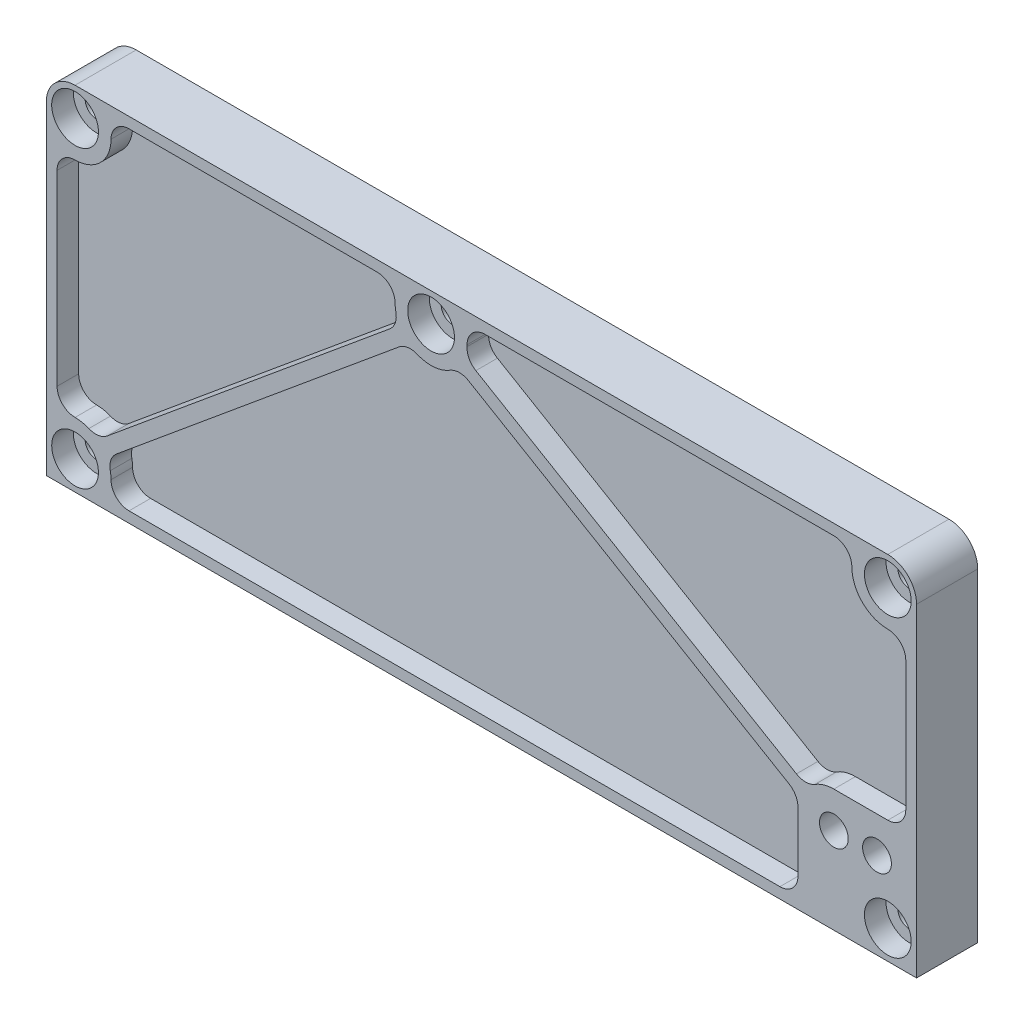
ISO-10303-21;
HEADER;
FILE_DESCRIPTION(('STEP AP214'),'2;1');
FILE_NAME('part.step','',(''),(''),'','','');
FILE_SCHEMA(('AUTOMOTIVE_DESIGN { 1 0 10303 214 1 1 1 1 }'));
ENDSEC;
DATA;
#1=APPLICATION_CONTEXT('core data for automotive mechanical design processes');
#2=APPLICATION_PROTOCOL_DEFINITION('international standard','automotive_design',2000,#1);
#3=PRODUCT_CONTEXT('',#1,'mechanical');
#4=PRODUCT('Part','Part','',(#3));
#5=PRODUCT_RELATED_PRODUCT_CATEGORY('part','',(#4));
#6=PRODUCT_DEFINITION_FORMATION('','',#4);
#7=PRODUCT_DEFINITION_CONTEXT('part definition',#1,'design');
#8=PRODUCT_DEFINITION('design','',#6,#7);
#9=PRODUCT_DEFINITION_SHAPE('','',#8);
#10=(LENGTH_UNIT() NAMED_UNIT(*) SI_UNIT(.MILLI.,.METRE.));
#11=(NAMED_UNIT(*) PLANE_ANGLE_UNIT() SI_UNIT($,.RADIAN.));
#12=(NAMED_UNIT(*) SI_UNIT($,.STERADIAN.) SOLID_ANGLE_UNIT());
#13=UNCERTAINTY_MEASURE_WITH_UNIT(LENGTH_MEASURE(1.E-05),#10,'distance_accuracy_value','');
#14=(GEOMETRIC_REPRESENTATION_CONTEXT(3) GLOBAL_UNCERTAINTY_ASSIGNED_CONTEXT((#13)) GLOBAL_UNIT_ASSIGNED_CONTEXT((#10,
#11,#12)) REPRESENTATION_CONTEXT('',''));
#15=CARTESIAN_POINT('',(0.,0.,0.));
#16=DIRECTION('',(0.,0.,1.));
#17=DIRECTION('',(1.,0.,0.));
#18=AXIS2_PLACEMENT_3D('',#15,#16,#17);
#19=CARTESIAN_POINT('',(60.5,24.5,5.5));
#20=DIRECTION('',(0.,0.,1.));
#21=DIRECTION('',(1.,0.,0.));
#22=AXIS2_PLACEMENT_3D('',#19,#20,#21);
#23=PLANE('',#22);
#24=CARTESIAN_POINT('',(117.,45.,5.5));
#25=DIRECTION('',(0.,0.,1.));
#26=DIRECTION('',(1.,0.,0.));
#27=AXIS2_PLACEMENT_3D('',#24,#25,#26);
#28=CIRCLE('',#27,4.99999999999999);
#29=CARTESIAN_POINT('',(112.,45.,5.5));
#30=VERTEX_POINT('',#29);
#31=CARTESIAN_POINT('',(117.,40.,5.5));
#32=VERTEX_POINT('',#31);
#33=EDGE_CURVE('E626',#30,#32,#28,.T.);
#34=ORIENTED_EDGE('',*,*,#33,.F.);
#35=CARTESIAN_POINT('',(109.5,45.,5.5));
#36=DIRECTION('',(0.,0.,1.));
#37=DIRECTION('',(1.,0.,0.));
#38=AXIS2_PLACEMENT_3D('',#35,#36,#37);
#39=CIRCLE('',#38,2.5);
#40=CARTESIAN_POINT('',(109.5,47.5,5.5));
#41=VERTEX_POINT('',#40);
#42=EDGE_CURVE('E800',#30,#41,#39,.T.);
#43=ORIENTED_EDGE('',*,*,#42,.T.);
#44=DIRECTION('',(1.,0.,0.));
#45=VECTOR('',#44,1.);
#46=CARTESIAN_POINT('',(58.5,47.5,5.5));
#47=LINE('',#46,#45);
#48=CARTESIAN_POINT('',(61.,47.5,5.5));
#49=VERTEX_POINT('',#48);
#50=EDGE_CURVE('E511',#49,#41,#47,.T.);
#51=ORIENTED_EDGE('',*,*,#50,.F.);
#52=CARTESIAN_POINT('',(61.,45.,5.50000000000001));
#53=DIRECTION('',(0.,0.,1.));
#54=DIRECTION('',(1.,0.,0.));
#55=AXIS2_PLACEMENT_3D('',#52,#53,#54);
#56=CIRCLE('',#55,2.5);
#57=CARTESIAN_POINT('',(58.5,45.,5.5));
#58=VERTEX_POINT('',#57);
#59=EDGE_CURVE('E790',#49,#58,#56,.T.);
#60=ORIENTED_EDGE('',*,*,#59,.T.);
#61=CARTESIAN_POINT('',(53.5,45.,5.5));
#62=DIRECTION('',(0.,0.,1.));
#63=DIRECTION('',(1.,0.,0.));
#64=AXIS2_PLACEMENT_3D('',#61,#62,#63);
#65=CIRCLE('',#64,5.);
#66=CARTESIAN_POINT('',(58.4944818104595,44.7651565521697,5.5));
#67=VERTEX_POINT('',#66);
#68=EDGE_CURVE('E601',#67,#58,#65,.T.);
#69=ORIENTED_EDGE('',*,*,#68,.F.);
#70=CARTESIAN_POINT('',(60.9917227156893,44.6477348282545,5.5));
#71=DIRECTION('',(0.,0.,1.));
#72=DIRECTION('',(1.,0.,0.));
#73=AXIS2_PLACEMENT_3D('',#70,#71,#72);
#74=CIRCLE('',#73,2.5);
#75=CARTESIAN_POINT('',(59.7224919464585,42.4938886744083,5.5));
#76=VERTEX_POINT('',#75);
#77=EDGE_CURVE('E792',#67,#76,#74,.T.);
#78=ORIENTED_EDGE('',*,*,#77,.T.);
#79=DIRECTION('',(0.861538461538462,-0.507692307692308,0.));
#80=VECTOR('',#79,1.);
#81=CARTESIAN_POINT('',(105.787033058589,15.3487126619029,5.5));
#82=LINE('',#81,#80);
#83=CARTESIAN_POINT('',(104.292892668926,16.2291882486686,5.5));
#84=VERTEX_POINT('',#83);
#85=EDGE_CURVE('E1092',#76,#84,#82,.T.);
#86=ORIENTED_EDGE('',*,*,#85,.T.);
#87=CARTESIAN_POINT('',(105.562123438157,18.3830344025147,5.5));
#88=DIRECTION('',(0.,0.,1.));
#89=DIRECTION('',(1.,0.,0.));
#90=AXIS2_PLACEMENT_3D('',#87,#88,#89);
#91=CIRCLE('',#90,2.5);
#92=CARTESIAN_POINT('',(106.874748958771,16.2553562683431,5.5));
#93=VERTEX_POINT('',#92);
#94=EDGE_CURVE('E794',#84,#93,#91,.T.);
#95=ORIENTED_EDGE('',*,*,#94,.T.);
#96=CARTESIAN_POINT('',(109.5,12.,5.5));
#97=DIRECTION('',(0.,0.,1.));
#98=DIRECTION('',(-1.,0.,0.));
#99=AXIS2_PLACEMENT_3D('',#96,#97,#98);
#100=CIRCLE('',#99,5.00000000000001);
#101=CARTESIAN_POINT('',(109.5,17.,5.5));
#102=VERTEX_POINT('',#101);
#103=EDGE_CURVE('E472',#102,#93,#100,.T.);
#104=ORIENTED_EDGE('',*,*,#103,.F.);
#105=DIRECTION('',(-1.,0.,0.));
#106=VECTOR('',#105,1.);
#107=CARTESIAN_POINT('',(109.5,17.,5.5));
#108=LINE('',#107,#106);
#109=CARTESIAN_POINT('',(117.,17.,5.5));
#110=VERTEX_POINT('',#109);
#111=EDGE_CURVE('E453',#110,#102,#108,.T.);
#112=ORIENTED_EDGE('',*,*,#111,.F.);
#113=CARTESIAN_POINT('',(117.,19.5,5.5));
#114=DIRECTION('',(0.,0.,1.));
#115=DIRECTION('',(1.,0.,0.));
#116=AXIS2_PLACEMENT_3D('',#113,#114,#115);
#117=CIRCLE('',#116,2.5);
#118=CARTESIAN_POINT('',(119.5,19.5,5.5));
#119=VERTEX_POINT('',#118);
#120=EDGE_CURVE('E796',#110,#119,#117,.T.);
#121=ORIENTED_EDGE('',*,*,#120,.T.);
#122=DIRECTION('',(0.,-1.,0.));
#123=VECTOR('',#122,1.);
#124=CARTESIAN_POINT('',(119.5,40.,5.5));
#125=LINE('',#124,#123);
#126=CARTESIAN_POINT('',(119.5,37.5,5.5));
#127=VERTEX_POINT('',#126);
#128=EDGE_CURVE('E505',#127,#119,#125,.T.);
#129=ORIENTED_EDGE('',*,*,#128,.F.);
#130=CARTESIAN_POINT('',(117.,37.5,5.50000000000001));
#131=DIRECTION('',(0.,0.,1.));
#132=DIRECTION('',(1.,0.,0.));
#133=AXIS2_PLACEMENT_3D('',#130,#131,#132);
#134=CIRCLE('',#133,2.5);
#135=EDGE_CURVE('E798',#127,#32,#134,.T.);
#136=ORIENTED_EDGE('',*,*,#135,.T.);
#137=EDGE_LOOP('',(#34,#43,#51,#60,#69,#78,#86,#95,#104,#112,#121,#129,#136));
#138=FACE_BOUND('',#137,.T.);
#139=ADVANCED_FACE('F39',(#138),#23,.T.);
#140=CARTESIAN_POINT('',(53.5,45.,5.5));
#141=DIRECTION('',(0.,0.,1.));
#142=DIRECTION('',(1.,0.,0.));
#143=AXIS2_PLACEMENT_3D('',#140,#141,#142);
#144=CYLINDRICAL_SURFACE('',#143,5.);
#145=CARTESIAN_POINT('',(53.5,45.,8.5));
#146=DIRECTION('',(0.,0.,1.));
#147=DIRECTION('',(1.,0.,0.));
#148=AXIS2_PLACEMENT_3D('',#145,#146,#147);
#149=CIRCLE('',#148,5.);
#150=CARTESIAN_POINT('',(58.4944818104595,44.7651565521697,8.5));
#151=VERTEX_POINT('',#150);
#152=CARTESIAN_POINT('',(58.5,45.,8.5));
#153=VERTEX_POINT('',#152);
#154=EDGE_CURVE('E592',#151,#153,#149,.T.);
#155=ORIENTED_EDGE('',*,*,#154,.F.);
#156=DIRECTION('',(0.,0.,1.));
#157=VECTOR('',#156,1.);
#158=CARTESIAN_POINT('',(58.4944818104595,44.7651565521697,5.5));
#159=LINE('',#158,#157);
#160=EDGE_CURVE('E820',#151,#67,#159,.F.);
#161=ORIENTED_EDGE('',*,*,#160,.T.);
#162=ORIENTED_EDGE('',*,*,#68,.T.);
#163=DIRECTION('',(0.,0.,1.));
#164=VECTOR('',#163,1.);
#165=CARTESIAN_POINT('',(58.5,45.,5.5));
#166=LINE('',#165,#164);
#167=EDGE_CURVE('E606',#58,#153,#166,.T.);
#168=ORIENTED_EDGE('',*,*,#167,.T.);
#169=EDGE_LOOP('',(#155,#161,#162,#168));
#170=FACE_BOUND('',#169,.T.);
#171=ADVANCED_FACE('F998',(#170),#144,.T.);
#172=CARTESIAN_POINT('',(109.5,12.,30.069654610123));
#173=DIRECTION('',(0.,0.,-1.));
#174=DIRECTION('',(-1.,0.,0.));
#175=AXIS2_PLACEMENT_3D('',#172,#173,#174);
#176=CYLINDRICAL_SURFACE('',#175,5.00000000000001);
#177=ORIENTED_EDGE('',*,*,#103,.T.);
#178=DIRECTION('',(0.,0.,-1.));
#179=VECTOR('',#178,1.);
#180=CARTESIAN_POINT('',(106.874748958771,16.2553562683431,30.069654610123));
#181=LINE('',#180,#179);
#182=CARTESIAN_POINT('',(106.874748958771,16.2553562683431,8.5));
#183=VERTEX_POINT('',#182);
#184=EDGE_CURVE('E450',#93,#183,#181,.F.);
#185=ORIENTED_EDGE('',*,*,#184,.T.);
#186=CARTESIAN_POINT('',(109.5,12.,8.5));
#187=DIRECTION('',(0.,0.,-1.));
#188=DIRECTION('',(-1.,0.,0.));
#189=AXIS2_PLACEMENT_3D('',#186,#187,#188);
#190=CIRCLE('',#189,5.00000000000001);
#191=CARTESIAN_POINT('',(109.5,17.,8.5));
#192=VERTEX_POINT('',#191);
#193=EDGE_CURVE('E443',#183,#192,#190,.T.);
#194=ORIENTED_EDGE('',*,*,#193,.T.);
#195=DIRECTION('',(0.,0.,-1.));
#196=VECTOR('',#195,1.);
#197=CARTESIAN_POINT('',(109.5,17.,30.069654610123));
#198=LINE('',#197,#196);
#199=EDGE_CURVE('E448',#192,#102,#198,.T.);
#200=ORIENTED_EDGE('',*,*,#199,.T.);
#201=EDGE_LOOP('',(#177,#185,#194,#200));
#202=FACE_BOUND('',#201,.T.);
#203=ADVANCED_FACE('F446',(#202),#176,.T.);
#204=DIRECTION('',(-1.,0.,0.));
#205=VECTOR('',#204,1.);
#206=CARTESIAN_POINT('',(112.,1.5,5.5));
#207=LINE('',#206,#205);
#208=CARTESIAN_POINT('',(102.,1.5,5.5));
#209=VERTEX_POINT('',#208);
#210=CARTESIAN_POINT('',(11.5,1.49999999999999,5.5));
#211=VERTEX_POINT('',#210);
#212=EDGE_CURVE('E493',#209,#211,#207,.T.);
#213=ORIENTED_EDGE('',*,*,#212,.F.);
#214=CARTESIAN_POINT('',(102.,4.,5.50000000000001));
#215=DIRECTION('',(0.,0.,1.));
#216=DIRECTION('',(1.,0.,0.));
#217=AXIS2_PLACEMENT_3D('',#214,#215,#216);
#218=CIRCLE('',#217,2.5);
#219=CARTESIAN_POINT('',(104.5,4.,5.5));
#220=VERTEX_POINT('',#219);
#221=EDGE_CURVE('E837',#209,#220,#218,.T.);
#222=ORIENTED_EDGE('',*,*,#221,.T.);
#223=DIRECTION('',(0.,-1.,0.));
#224=VECTOR('',#223,1.);
#225=CARTESIAN_POINT('',(104.5,1.5,5.5));
#226=LINE('',#225,#224);
#227=CARTESIAN_POINT('',(104.5,12.,5.5));
#228=VERTEX_POINT('',#227);
#229=EDGE_CURVE('E479',#228,#220,#226,.T.);
#230=ORIENTED_EDGE('',*,*,#229,.F.);
#231=CARTESIAN_POINT('',(104.50551818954,12.2348434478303,5.5));
#232=VERTEX_POINT('',#231);
#233=EDGE_CURVE('E470',#232,#228,#100,.T.);
#234=ORIENTED_EDGE('',*,*,#233,.F.);
#235=CARTESIAN_POINT('',(102.008277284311,12.3522651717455,5.5));
#236=DIRECTION('',(0.,0.,1.));
#237=DIRECTION('',(1.,0.,0.));
#238=AXIS2_PLACEMENT_3D('',#235,#236,#237);
#239=CIRCLE('',#238,2.5);
#240=CARTESIAN_POINT('',(103.277508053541,14.5061113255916,5.5));
#241=VERTEX_POINT('',#240);
#242=EDGE_CURVE('E835',#232,#241,#239,.T.);
#243=ORIENTED_EDGE('',*,*,#242,.T.);
#244=DIRECTION('',(-0.861538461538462,0.507692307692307,0.));
#245=VECTOR('',#244,1.);
#246=CARTESIAN_POINT('',(104.771648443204,13.625635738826,5.5));
#247=LINE('',#246,#245);
#248=CARTESIAN_POINT('',(58.7071073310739,40.7708117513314,5.5));
#249=VERTEX_POINT('',#248);
#250=EDGE_CURVE('E1087',#241,#249,#247,.T.);
#251=ORIENTED_EDGE('',*,*,#250,.T.);
#252=CARTESIAN_POINT('',(57.4378765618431,38.6169655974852,5.5));
#253=DIRECTION('',(0.,0.,1.));
#254=DIRECTION('',(1.,0.,0.));
#255=AXIS2_PLACEMENT_3D('',#252,#253,#254);
#256=CIRCLE('',#255,2.5);
#257=CARTESIAN_POINT('',(56.1252510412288,40.7446437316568,5.5));
#258=VERTEX_POINT('',#257);
#259=EDGE_CURVE('E833',#249,#258,#256,.T.);
#260=ORIENTED_EDGE('',*,*,#259,.T.);
#261=CARTESIAN_POINT('',(51.5827545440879,40.382189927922,5.5));
#262=VERTEX_POINT('',#261);
#263=EDGE_CURVE('E600',#262,#258,#65,.T.);
#264=ORIENTED_EDGE('',*,*,#263,.F.);
#265=CARTESIAN_POINT('',(50.6241318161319,38.0732848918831,5.5));
#266=DIRECTION('',(0.,0.,1.));
#267=DIRECTION('',(1.,0.,0.));
#268=AXIS2_PLACEMENT_3D('',#265,#266,#267);
#269=CIRCLE('',#268,2.5);
#270=CARTESIAN_POINT('',(49.0294166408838,39.9986117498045,5.5));
#271=VERTEX_POINT('',#270);
#272=EDGE_CURVE('E831',#262,#271,#269,.T.);
#273=ORIENTED_EDGE('',*,*,#272,.T.);
#274=DIRECTION('',(-0.77013074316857,-0.637886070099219,0.));
#275=VECTOR('',#274,1.);
#276=CARTESIAN_POINT('',(8.41074078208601,6.35486002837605,5.5));
#277=LINE('',#276,#275);
#278=CARTESIAN_POINT('',(9.74635549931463,7.46112676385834,5.5));
#279=VERTEX_POINT('',#278);
#280=EDGE_CURVE('E1035',#271,#279,#277,.T.);
#281=ORIENTED_EDGE('',*,*,#280,.T.);
#282=CARTESIAN_POINT('',(11.3410706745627,5.53579990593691,5.5));
#283=DIRECTION('',(0.,0.,1.));
#284=DIRECTION('',(1.,0.,0.));
#285=AXIS2_PLACEMENT_3D('',#282,#283,#284);
#286=CIRCLE('',#285,2.5);
#287=CARTESIAN_POINT('',(8.89404711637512,5.02386660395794,5.5));
#288=VERTEX_POINT('',#287);
#289=EDGE_CURVE('E827',#279,#288,#286,.T.);
#290=ORIENTED_EDGE('',*,*,#289,.T.);
#291=CARTESIAN_POINT('',(4.,4.,5.5));
#292=DIRECTION('',(0.,0.,1.));
#293=DIRECTION('',(1.,0.,0.));
#294=AXIS2_PLACEMENT_3D('',#291,#292,#293);
#295=CIRCLE('',#294,5.);
#296=CARTESIAN_POINT('',(9.,4.,5.5));
#297=VERTEX_POINT('',#296);
#298=EDGE_CURVE('E612',#297,#288,#295,.T.);
#299=ORIENTED_EDGE('',*,*,#298,.F.);
#300=CARTESIAN_POINT('',(11.5,3.99999999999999,5.5));
#301=DIRECTION('',(0.,0.,1.));
#302=DIRECTION('',(1.,0.,0.));
#303=AXIS2_PLACEMENT_3D('',#300,#301,#302);
#304=CIRCLE('',#303,2.5);
#305=EDGE_CURVE('E829',#297,#211,#304,.T.);
#306=ORIENTED_EDGE('',*,*,#305,.T.);
#307=EDGE_LOOP('',(#213,#222,#230,#234,#243,#251,#260,#264,#273,#281,#290,#299,#306));
#308=FACE_BOUND('',#307,.T.);
#309=ADVANCED_FACE('F1001',(#308),#23,.T.);
#310=CARTESIAN_POINT('',(4.,4.,5.5));
#311=DIRECTION('',(0.,0.,1.));
#312=DIRECTION('',(1.,0.,0.));
#313=AXIS2_PLACEMENT_3D('',#310,#311,#312);
#314=CYLINDRICAL_SURFACE('',#313,5.);
#315=ORIENTED_EDGE('',*,*,#298,.T.);
#316=DIRECTION('',(0.,0.,1.));
#317=VECTOR('',#316,1.);
#318=CARTESIAN_POINT('',(8.89404711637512,5.02386660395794,5.5));
#319=LINE('',#318,#317);
#320=CARTESIAN_POINT('',(8.89404711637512,5.02386660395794,8.5));
#321=VERTEX_POINT('',#320);
#322=EDGE_CURVE('E888',#288,#321,#319,.T.);
#323=ORIENTED_EDGE('',*,*,#322,.T.);
#324=CARTESIAN_POINT('',(4.,4.,8.5));
#325=DIRECTION('',(0.,0.,1.));
#326=DIRECTION('',(1.,0.,0.));
#327=AXIS2_PLACEMENT_3D('',#324,#325,#326);
#328=CIRCLE('',#327,5.);
#329=CARTESIAN_POINT('',(9.,4.,8.5));
#330=VERTEX_POINT('',#329);
#331=EDGE_CURVE('E617',#330,#321,#328,.T.);
#332=ORIENTED_EDGE('',*,*,#331,.F.);
#333=DIRECTION('',(0.,0.,1.));
#334=VECTOR('',#333,1.);
#335=CARTESIAN_POINT('',(9.,4.,5.5));
#336=LINE('',#335,#334);
#337=EDGE_CURVE('E620',#297,#330,#336,.T.);
#338=ORIENTED_EDGE('',*,*,#337,.F.);
#339=EDGE_LOOP('',(#315,#323,#332,#338));
#340=FACE_BOUND('',#339,.T.);
#341=ADVANCED_FACE('F1014',(#340),#314,.T.);
#342=ORIENTED_EDGE('',*,*,#263,.T.);
#343=DIRECTION('',(0.,0.,1.));
#344=VECTOR('',#343,1.);
#345=CARTESIAN_POINT('',(56.1252510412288,40.7446437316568,5.5));
#346=LINE('',#345,#344);
#347=CARTESIAN_POINT('',(56.1252510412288,40.7446437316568,8.5));
#348=VERTEX_POINT('',#347);
#349=EDGE_CURVE('E850',#258,#348,#346,.T.);
#350=ORIENTED_EDGE('',*,*,#349,.T.);
#351=CARTESIAN_POINT('',(51.5827545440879,40.382189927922,8.5));
#352=VERTEX_POINT('',#351);
#353=EDGE_CURVE('E605',#352,#348,#149,.T.);
#354=ORIENTED_EDGE('',*,*,#353,.F.);
#355=DIRECTION('',(0.,0.,1.));
#356=VECTOR('',#355,1.);
#357=CARTESIAN_POINT('',(51.5827545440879,40.382189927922,5.5));
#358=LINE('',#357,#356);
#359=EDGE_CURVE('E848',#352,#262,#358,.F.);
#360=ORIENTED_EDGE('',*,*,#359,.T.);
#361=EDGE_LOOP('',(#342,#350,#354,#360));
#362=FACE_BOUND('',#361,.T.);
#363=ADVANCED_FACE('F1008',(#362),#144,.T.);
#364=DIRECTION('',(0.77013074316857,0.637886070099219,0.));
#365=VECTOR('',#364,1.);
#366=CARTESIAN_POINT('',(7.13496864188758,7.89512151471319,5.5));
#367=LINE('',#366,#365);
#368=CARTESIAN_POINT('',(8.4705833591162,9.00138825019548,5.5));
#369=VERTEX_POINT('',#368);
#370=CARTESIAN_POINT('',(47.7536445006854,41.5388732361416,5.5));
#371=VERTEX_POINT('',#370);
#372=EDGE_CURVE('E465',#369,#371,#367,.T.);
#373=ORIENTED_EDGE('',*,*,#372,.T.);
#374=CARTESIAN_POINT('',(46.1589293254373,43.464200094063,5.5));
#375=DIRECTION('',(0.,0.,1.));
#376=DIRECTION('',(1.,0.,0.));
#377=AXIS2_PLACEMENT_3D('',#374,#375,#376);
#378=CIRCLE('',#377,2.5);
#379=CARTESIAN_POINT('',(48.6059528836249,43.976133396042,5.5));
#380=VERTEX_POINT('',#379);
#381=EDGE_CURVE('E876',#371,#380,#378,.T.);
#382=ORIENTED_EDGE('',*,*,#381,.T.);
#383=CARTESIAN_POINT('',(48.5,45.,5.5));
#384=VERTEX_POINT('',#383);
#385=EDGE_CURVE('E596',#384,#380,#65,.T.);
#386=ORIENTED_EDGE('',*,*,#385,.F.);
#387=CARTESIAN_POINT('',(46.,45.,5.5));
#388=DIRECTION('',(0.,0.,1.));
#389=DIRECTION('',(1.,0.,0.));
#390=AXIS2_PLACEMENT_3D('',#387,#388,#389);
#391=CIRCLE('',#390,2.5);
#392=CARTESIAN_POINT('',(46.,47.5,5.5));
#393=VERTEX_POINT('',#392);
#394=EDGE_CURVE('E874',#384,#393,#391,.T.);
#395=ORIENTED_EDGE('',*,*,#394,.T.);
#396=DIRECTION('',(1.,0.,0.));
#397=VECTOR('',#396,1.);
#398=CARTESIAN_POINT('',(9.,47.5,5.5));
#399=LINE('',#398,#397);
#400=CARTESIAN_POINT('',(11.5,47.5,5.5));
#401=VERTEX_POINT('',#400);
#402=EDGE_CURVE('E517',#401,#393,#399,.T.);
#403=ORIENTED_EDGE('',*,*,#402,.F.);
#404=CARTESIAN_POINT('',(11.5,45.,5.50000000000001));
#405=DIRECTION('',(0.,0.,1.));
#406=DIRECTION('',(1.,0.,0.));
#407=AXIS2_PLACEMENT_3D('',#404,#405,#406);
#408=CIRCLE('',#407,2.5);
#409=CARTESIAN_POINT('',(9.,45.,5.5));
#410=VERTEX_POINT('',#409);
#411=EDGE_CURVE('E872',#401,#410,#408,.T.);
#412=ORIENTED_EDGE('',*,*,#411,.T.);
#413=CARTESIAN_POINT('',(4.,45.,5.5));
#414=DIRECTION('',(0.,0.,1.));
#415=DIRECTION('',(-1.,0.,0.));
#416=AXIS2_PLACEMENT_3D('',#413,#414,#415);
#417=CIRCLE('',#416,5.);
#418=CARTESIAN_POINT('',(4.,40.,5.5));
#419=VERTEX_POINT('',#418);
#420=EDGE_CURVE('E637',#419,#410,#417,.T.);
#421=ORIENTED_EDGE('',*,*,#420,.F.);
#422=CARTESIAN_POINT('',(4.,37.5,5.5));
#423=DIRECTION('',(0.,0.,1.));
#424=DIRECTION('',(1.,0.,0.));
#425=AXIS2_PLACEMENT_3D('',#422,#423,#424);
#426=CIRCLE('',#425,2.5);
#427=CARTESIAN_POINT('',(1.5,37.5,5.5));
#428=VERTEX_POINT('',#427);
#429=EDGE_CURVE('E870',#419,#428,#426,.T.);
#430=ORIENTED_EDGE('',*,*,#429,.T.);
#431=DIRECTION('',(0.,1.,0.));
#432=VECTOR('',#431,1.);
#433=CARTESIAN_POINT('',(1.5,40.,5.5));
#434=LINE('',#433,#432);
#435=CARTESIAN_POINT('',(1.50000000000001,11.5,5.5));
#436=VERTEX_POINT('',#435);
#437=EDGE_CURVE('E499',#436,#428,#434,.T.);
#438=ORIENTED_EDGE('',*,*,#437,.F.);
#439=CARTESIAN_POINT('',(4.00000000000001,11.5,5.50000000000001));
#440=DIRECTION('',(0.,0.,1.));
#441=DIRECTION('',(1.,0.,0.));
#442=AXIS2_PLACEMENT_3D('',#439,#440,#441);
#443=CIRCLE('',#442,2.5);
#444=CARTESIAN_POINT('',(4.,9.,5.5));
#445=VERTEX_POINT('',#444);
#446=EDGE_CURVE('E866',#436,#445,#443,.T.);
#447=ORIENTED_EDGE('',*,*,#446,.T.);
#448=CARTESIAN_POINT('',(5.9172454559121,8.61781007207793,5.5));
#449=VERTEX_POINT('',#448);
#450=EDGE_CURVE('E616',#449,#445,#295,.T.);
#451=ORIENTED_EDGE('',*,*,#450,.F.);
#452=CARTESIAN_POINT('',(6.87586818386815,10.9267151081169,5.5));
#453=DIRECTION('',(0.,0.,1.));
#454=DIRECTION('',(1.,0.,0.));
#455=AXIS2_PLACEMENT_3D('',#452,#453,#454);
#456=CIRCLE('',#455,2.5);
#457=EDGE_CURVE('E868',#449,#369,#456,.T.);
#458=ORIENTED_EDGE('',*,*,#457,.T.);
#459=EDGE_LOOP('',(#373,#382,#386,#395,#403,#412,#421,#430,#438,#447,#451,#458));
#460=FACE_BOUND('',#459,.T.);
#461=ADVANCED_FACE('F1002',(#460),#23,.T.);
#462=CARTESIAN_POINT('',(119.5,40.,111.510921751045));
#463=DIRECTION('',(1.,0.,0.));
#464=DIRECTION('',(0.,0.,-1.));
#465=AXIS2_PLACEMENT_3D('',#462,#463,#464);
#466=PLANE('',#465);
#467=DIRECTION('',(0.,1.,0.));
#468=VECTOR('',#467,1.);
#469=CARTESIAN_POINT('',(119.5,40.,8.50000000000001));
#470=LINE('',#469,#468);
#471=CARTESIAN_POINT('',(119.5,19.5,8.50000000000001));
#472=VERTEX_POINT('',#471);
#473=CARTESIAN_POINT('',(119.5,37.5,8.50000000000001));
#474=VERTEX_POINT('',#473);
#475=EDGE_CURVE('E508',#472,#474,#470,.T.);
#476=ORIENTED_EDGE('',*,*,#475,.T.);
#477=DIRECTION('',(0.,0.,-1.));
#478=VECTOR('',#477,1.);
#479=CARTESIAN_POINT('',(119.5,37.5,111.510921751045));
#480=LINE('',#479,#478);
#481=EDGE_CURVE('E809',#474,#127,#480,.T.);
#482=ORIENTED_EDGE('',*,*,#481,.T.);
#483=ORIENTED_EDGE('',*,*,#128,.T.);
#484=DIRECTION('',(0.,0.,-1.));
#485=VECTOR('',#484,1.);
#486=CARTESIAN_POINT('',(119.5,19.5,8.50000000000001));
#487=LINE('',#486,#485);
#488=EDGE_CURVE('E807',#119,#472,#487,.F.);
#489=ORIENTED_EDGE('',*,*,#488,.T.);
#490=EDGE_LOOP('',(#476,#482,#483,#489));
#491=FACE_BOUND('',#490,.T.);
#492=ADVANCED_FACE('F1017',(#491),#466,.F.);
#493=CARTESIAN_POINT('',(112.,1.5,111.510921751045));
#494=DIRECTION('',(0.,-1.,0.));
#495=DIRECTION('',(1.,0.,0.));
#496=AXIS2_PLACEMENT_3D('',#493,#494,#495);
#497=PLANE('',#496);
#498=DIRECTION('',(1.,0.,0.));
#499=VECTOR('',#498,1.);
#500=CARTESIAN_POINT('',(112.,1.5,8.50000000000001));
#501=LINE('',#500,#499);
#502=CARTESIAN_POINT('',(11.5,1.49999999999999,8.50000000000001));
#503=VERTEX_POINT('',#502);
#504=CARTESIAN_POINT('',(102.,1.5,8.50000000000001));
#505=VERTEX_POINT('',#504);
#506=EDGE_CURVE('E496',#503,#505,#501,.T.);
#507=ORIENTED_EDGE('',*,*,#506,.T.);
#508=DIRECTION('',(0.,0.,-1.));
#509=VECTOR('',#508,1.);
#510=CARTESIAN_POINT('',(102.,1.5,5.50000000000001));
#511=LINE('',#510,#509);
#512=EDGE_CURVE('E824',#505,#209,#511,.T.);
#513=ORIENTED_EDGE('',*,*,#512,.T.);
#514=ORIENTED_EDGE('',*,*,#212,.T.);
#515=DIRECTION('',(0.,0.,-1.));
#516=VECTOR('',#515,1.);
#517=CARTESIAN_POINT('',(11.5,1.49999999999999,111.510921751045));
#518=LINE('',#517,#516);
#519=EDGE_CURVE('E822',#211,#503,#518,.F.);
#520=ORIENTED_EDGE('',*,*,#519,.T.);
#521=EDGE_LOOP('',(#507,#513,#514,#520));
#522=FACE_BOUND('',#521,.T.);
#523=ADVANCED_FACE('F1023',(#522),#497,.F.);
#524=CARTESIAN_POINT('',(0.,0.,4.));
#525=DIRECTION('',(0.,0.,-1.));
#526=DIRECTION('',(-1.,0.,0.));
#527=AXIS2_PLACEMENT_3D('',#524,#525,#526);
#528=PLANE('',#527);
#529=CARTESIAN_POINT('',(115.5,12.,4.));
#530=DIRECTION('',(0.,0.,-1.));
#531=DIRECTION('',(-1.,0.,0.));
#532=AXIS2_PLACEMENT_3D('',#529,#530,#531);
#533=CIRCLE('',#532,2.);
#534=CARTESIAN_POINT('',(113.5,12.,4.));
#535=VERTEX_POINT('',#534);
#536=EDGE_CURVE('E490',#535,#535,#533,.T.);
#537=ORIENTED_EDGE('',*,*,#536,.F.);
#538=EDGE_LOOP('',(#537));
#539=FACE_BOUND('',#538,.T.);
#540=CARTESIAN_POINT('',(109.5,12.,4.));
#541=DIRECTION('',(0.,0.,-1.));
#542=DIRECTION('',(-1.,0.,0.));
#543=AXIS2_PLACEMENT_3D('',#540,#541,#542);
#544=CIRCLE('',#543,2.);
#545=CARTESIAN_POINT('',(107.5,12.,4.));
#546=VERTEX_POINT('',#545);
#547=EDGE_CURVE('E486',#546,#546,#544,.T.);
#548=ORIENTED_EDGE('',*,*,#547,.F.);
#549=EDGE_LOOP('',(#548));
#550=FACE_BOUND('',#549,.T.);
#551=DIRECTION('',(0.,1.,0.));
#552=VECTOR('',#551,1.);
#553=CARTESIAN_POINT('',(1.5,1.5,4.));
#554=LINE('',#553,#552);
#555=CARTESIAN_POINT('',(1.5,11.5,4.));
#556=VERTEX_POINT('',#555);
#557=CARTESIAN_POINT('',(1.5,37.5,4.));
#558=VERTEX_POINT('',#557);
#559=EDGE_CURVE('E698',#556,#558,#554,.T.);
#560=ORIENTED_EDGE('',*,*,#559,.T.);
#561=CARTESIAN_POINT('',(4.,37.5,4.));
#562=DIRECTION('',(0.,0.,-1.));
#563=DIRECTION('',(-1.,0.,0.));
#564=AXIS2_PLACEMENT_3D('',#561,#562,#563);
#565=CIRCLE('',#564,2.5);
#566=CARTESIAN_POINT('',(4.,40.,4.));
#567=VERTEX_POINT('',#566);
#568=EDGE_CURVE('E764',#558,#567,#565,.T.);
#569=ORIENTED_EDGE('',*,*,#568,.T.);
#570=CARTESIAN_POINT('',(4.,45.,4.));
#571=DIRECTION('',(0.,0.,-1.));
#572=DIRECTION('',(-1.,0.,0.));
#573=AXIS2_PLACEMENT_3D('',#570,#571,#572);
#574=CIRCLE('',#573,5.);
#575=CARTESIAN_POINT('',(9.,45.,4.));
#576=VERTEX_POINT('',#575);
#577=EDGE_CURVE('E585',#576,#567,#574,.T.);
#578=ORIENTED_EDGE('',*,*,#577,.F.);
#579=CARTESIAN_POINT('',(11.5,45.,4.));
#580=DIRECTION('',(0.,0.,-1.));
#581=DIRECTION('',(-1.,0.,0.));
#582=AXIS2_PLACEMENT_3D('',#579,#580,#581);
#583=CIRCLE('',#582,2.5);
#584=CARTESIAN_POINT('',(11.5,47.5,4.));
#585=VERTEX_POINT('',#584);
#586=EDGE_CURVE('E762',#576,#585,#583,.T.);
#587=ORIENTED_EDGE('',*,*,#586,.T.);
#588=DIRECTION('',(1.,0.,0.));
#589=VECTOR('',#588,1.);
#590=CARTESIAN_POINT('',(1.5,47.5,4.));
#591=LINE('',#590,#589);
#592=CARTESIAN_POINT('',(46.,47.5,4.));
#593=VERTEX_POINT('',#592);
#594=EDGE_CURVE('E737',#585,#593,#591,.T.);
#595=ORIENTED_EDGE('',*,*,#594,.T.);
#596=CARTESIAN_POINT('',(46.,45.,4.));
#597=DIRECTION('',(0.,0.,-1.));
#598=DIRECTION('',(-1.,0.,0.));
#599=AXIS2_PLACEMENT_3D('',#596,#597,#598);
#600=CIRCLE('',#599,2.5);
#601=CARTESIAN_POINT('',(48.5,45.,4.));
#602=VERTEX_POINT('',#601);
#603=EDGE_CURVE('E756',#593,#602,#600,.T.);
#604=ORIENTED_EDGE('',*,*,#603,.T.);
#605=CARTESIAN_POINT('',(53.5,45.,4.));
#606=DIRECTION('',(0.,0.,-1.));
#607=DIRECTION('',(-1.,0.,0.));
#608=AXIS2_PLACEMENT_3D('',#605,#606,#607);
#609=CIRCLE('',#608,5.);
#610=CARTESIAN_POINT('',(58.5,45.,4.));
#611=VERTEX_POINT('',#610);
#612=EDGE_CURVE('E541',#611,#602,#609,.T.);
#613=ORIENTED_EDGE('',*,*,#612,.F.);
#614=CARTESIAN_POINT('',(61.,45.,4.));
#615=DIRECTION('',(0.,0.,-1.));
#616=DIRECTION('',(-1.,0.,0.));
#617=AXIS2_PLACEMENT_3D('',#614,#615,#616);
#618=CIRCLE('',#617,2.5);
#619=CARTESIAN_POINT('',(61.,47.5,4.));
#620=VERTEX_POINT('',#619);
#621=EDGE_CURVE('E754',#611,#620,#618,.T.);
#622=ORIENTED_EDGE('',*,*,#621,.T.);
#623=CARTESIAN_POINT('',(109.5,47.5,4.));
#624=VERTEX_POINT('',#623);
#625=EDGE_CURVE('E736',#620,#624,#591,.T.);
#626=ORIENTED_EDGE('',*,*,#625,.T.);
#627=CARTESIAN_POINT('',(109.5,45.,4.));
#628=DIRECTION('',(0.,0.,-1.));
#629=DIRECTION('',(-1.,0.,0.));
#630=AXIS2_PLACEMENT_3D('',#627,#628,#629);
#631=CIRCLE('',#630,2.5);
#632=CARTESIAN_POINT('',(112.,45.,4.));
#633=VERTEX_POINT('',#632);
#634=EDGE_CURVE('E746',#624,#633,#631,.T.);
#635=ORIENTED_EDGE('',*,*,#634,.T.);
#636=CARTESIAN_POINT('',(117.,45.,4.));
#637=DIRECTION('',(0.,0.,-1.));
#638=DIRECTION('',(-1.,0.,0.));
#639=AXIS2_PLACEMENT_3D('',#636,#637,#638);
#640=CIRCLE('',#639,4.99999999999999);
#641=CARTESIAN_POINT('',(117.,40.,4.));
#642=VERTEX_POINT('',#641);
#643=EDGE_CURVE('E574',#642,#633,#640,.T.);
#644=ORIENTED_EDGE('',*,*,#643,.F.);
#645=CARTESIAN_POINT('',(117.,37.5,4.));
#646=DIRECTION('',(0.,0.,-1.));
#647=DIRECTION('',(-1.,0.,0.));
#648=AXIS2_PLACEMENT_3D('',#645,#646,#647);
#649=CIRCLE('',#648,2.5);
#650=CARTESIAN_POINT('',(119.5,37.5,4.));
#651=VERTEX_POINT('',#650);
#652=EDGE_CURVE('E748',#642,#651,#649,.T.);
#653=ORIENTED_EDGE('',*,*,#652,.T.);
#654=DIRECTION('',(0.,-1.,0.));
#655=VECTOR('',#654,1.);
#656=CARTESIAN_POINT('',(119.5,1.5,4.));
#657=LINE('',#656,#655);
#658=CARTESIAN_POINT('',(119.5,11.5,4.));
#659=VERTEX_POINT('',#658);
#660=EDGE_CURVE('E690',#651,#659,#657,.T.);
#661=ORIENTED_EDGE('',*,*,#660,.T.);
#662=CARTESIAN_POINT('',(117.,11.5,4.));
#663=DIRECTION('',(0.,0.,-1.));
#664=DIRECTION('',(-1.,0.,0.));
#665=AXIS2_PLACEMENT_3D('',#662,#663,#664);
#666=CIRCLE('',#665,2.5);
#667=CARTESIAN_POINT('',(117.,9.,4.));
#668=VERTEX_POINT('',#667);
#669=EDGE_CURVE('E750',#659,#668,#666,.T.);
#670=ORIENTED_EDGE('',*,*,#669,.T.);
#671=CARTESIAN_POINT('',(117.,4.,4.));
#672=DIRECTION('',(0.,0.,-1.));
#673=DIRECTION('',(-1.,0.,0.));
#674=AXIS2_PLACEMENT_3D('',#671,#672,#673);
#675=CIRCLE('',#674,4.99999999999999);
#676=CARTESIAN_POINT('',(112.,4.,4.));
#677=VERTEX_POINT('',#676);
#678=EDGE_CURVE('E563',#677,#668,#675,.T.);
#679=ORIENTED_EDGE('',*,*,#678,.F.);
#680=CARTESIAN_POINT('',(109.5,4.,4.));
#681=DIRECTION('',(0.,0.,-1.));
#682=DIRECTION('',(-1.,0.,0.));
#683=AXIS2_PLACEMENT_3D('',#680,#681,#682);
#684=CIRCLE('',#683,2.5);
#685=CARTESIAN_POINT('',(109.5,1.5,4.));
#686=VERTEX_POINT('',#685);
#687=EDGE_CURVE('E752',#677,#686,#684,.T.);
#688=ORIENTED_EDGE('',*,*,#687,.T.);
#689=DIRECTION('',(-1.,0.,0.));
#690=VECTOR('',#689,1.);
#691=CARTESIAN_POINT('',(1.5,1.5,4.));
#692=LINE('',#691,#690);
#693=CARTESIAN_POINT('',(11.5,1.5,4.));
#694=VERTEX_POINT('',#693);
#695=EDGE_CURVE('E695',#686,#694,#692,.T.);
#696=ORIENTED_EDGE('',*,*,#695,.T.);
#697=CARTESIAN_POINT('',(11.5,4.,4.));
#698=DIRECTION('',(0.,0.,-1.));
#699=DIRECTION('',(-1.,0.,0.));
#700=AXIS2_PLACEMENT_3D('',#697,#698,#699);
#701=CIRCLE('',#700,2.5);
#702=CARTESIAN_POINT('',(9.,4.,4.));
#703=VERTEX_POINT('',#702);
#704=EDGE_CURVE('E760',#694,#703,#701,.T.);
#705=ORIENTED_EDGE('',*,*,#704,.T.);
#706=CARTESIAN_POINT('',(4.,4.,4.));
#707=DIRECTION('',(0.,0.,-1.));
#708=DIRECTION('',(-1.,0.,0.));
#709=AXIS2_PLACEMENT_3D('',#706,#707,#708);
#710=CIRCLE('',#709,5.);
#711=CARTESIAN_POINT('',(4.,9.,4.));
#712=VERTEX_POINT('',#711);
#713=EDGE_CURVE('E552',#712,#703,#710,.T.);
#714=ORIENTED_EDGE('',*,*,#713,.F.);
#715=CARTESIAN_POINT('',(4.,11.5,4.));
#716=DIRECTION('',(0.,0.,-1.));
#717=DIRECTION('',(-1.,0.,0.));
#718=AXIS2_PLACEMENT_3D('',#715,#716,#717);
#719=CIRCLE('',#718,2.5);
#720=EDGE_CURVE('E758',#712,#556,#719,.T.);
#721=ORIENTED_EDGE('',*,*,#720,.T.);
#722=EDGE_LOOP('',(#560,#569,#578,#587,#595,#604,#613,#622,#626,#635,#644,#653,#661,#670,#679,
#688,#696,#705,#714,#721));
#723=FACE_BOUND('',#722,.T.);
#724=ADVANCED_FACE('F1699',(#539,#550,#723),#528,.T.);
#725=CARTESIAN_POINT('',(1.5,47.5,8.5));
#726=DIRECTION('',(0.,-1.,0.));
#727=DIRECTION('',(0.,0.,-1.));
#728=AXIS2_PLACEMENT_3D('',#725,#726,#727);
#729=PLANE('',#728);
#730=ORIENTED_EDGE('',*,*,#625,.F.);
#731=DIRECTION('',(0.,0.,-1.));
#732=VECTOR('',#731,1.);
#733=CARTESIAN_POINT('',(61.,47.5,8.5));
#734=LINE('',#733,#732);
#735=CARTESIAN_POINT('',(61.,47.5,0.));
#736=VERTEX_POINT('',#735);
#737=EDGE_CURVE('E781',#620,#736,#734,.T.);
#738=ORIENTED_EDGE('',*,*,#737,.T.);
#739=DIRECTION('',(-1.,0.,0.));
#740=VECTOR('',#739,1.);
#741=CARTESIAN_POINT('',(1.5,47.5,0.));
#742=LINE('',#741,#740);
#743=CARTESIAN_POINT('',(109.5,47.5,0.));
#744=VERTEX_POINT('',#743);
#745=EDGE_CURVE('E711',#744,#736,#742,.T.);
#746=ORIENTED_EDGE('',*,*,#745,.F.);
#747=DIRECTION('',(0.,0.,1.));
#748=VECTOR('',#747,1.);
#749=CARTESIAN_POINT('',(109.5,47.5,8.5));
#750=LINE('',#749,#748);
#751=EDGE_CURVE('E778',#744,#624,#750,.T.);
#752=ORIENTED_EDGE('',*,*,#751,.T.);
#753=EDGE_LOOP('',(#730,#738,#746,#752));
#754=FACE_BOUND('',#753,.T.);
#755=ADVANCED_FACE('F1689',(#754),#729,.T.);
#756=ORIENTED_EDGE('',*,*,#594,.F.);
#757=DIRECTION('',(0.,0.,-1.));
#758=VECTOR('',#757,1.);
#759=CARTESIAN_POINT('',(11.5,47.5,8.5));
#760=LINE('',#759,#758);
#761=CARTESIAN_POINT('',(11.5,47.5,0.));
#762=VERTEX_POINT('',#761);
#763=EDGE_CURVE('E769',#585,#762,#760,.T.);
#764=ORIENTED_EDGE('',*,*,#763,.T.);
#765=CARTESIAN_POINT('',(46.,47.5,0.));
#766=VERTEX_POINT('',#765);
#767=EDGE_CURVE('E710',#766,#762,#742,.T.);
#768=ORIENTED_EDGE('',*,*,#767,.F.);
#769=DIRECTION('',(0.,0.,1.));
#770=VECTOR('',#769,1.);
#771=CARTESIAN_POINT('',(46.,47.5,8.5));
#772=LINE('',#771,#770);
#773=EDGE_CURVE('E766',#766,#593,#772,.T.);
#774=ORIENTED_EDGE('',*,*,#773,.T.);
#775=EDGE_LOOP('',(#756,#764,#768,#774));
#776=FACE_BOUND('',#775,.T.);
#777=ADVANCED_FACE('F1679',(#776),#729,.T.);
#778=CARTESIAN_POINT('',(1.5,1.5,8.5));
#779=DIRECTION('',(0.,1.,0.));
#780=DIRECTION('',(0.,0.,1.));
#781=AXIS2_PLACEMENT_3D('',#778,#779,#780);
#782=PLANE('',#781);
#783=DIRECTION('',(1.,0.,0.));
#784=VECTOR('',#783,1.);
#785=CARTESIAN_POINT('',(1.5,1.5,0.));
#786=LINE('',#785,#784);
#787=CARTESIAN_POINT('',(11.5,1.5,0.));
#788=VERTEX_POINT('',#787);
#789=CARTESIAN_POINT('',(109.5,1.5,0.));
#790=VERTEX_POINT('',#789);
#791=EDGE_CURVE('E704',#788,#790,#786,.T.);
#792=ORIENTED_EDGE('',*,*,#791,.F.);
#793=DIRECTION('',(0.,0.,1.));
#794=VECTOR('',#793,1.);
#795=CARTESIAN_POINT('',(11.5,1.5,8.5));
#796=LINE('',#795,#794);
#797=EDGE_CURVE('E775',#788,#694,#796,.T.);
#798=ORIENTED_EDGE('',*,*,#797,.T.);
#799=ORIENTED_EDGE('',*,*,#695,.F.);
#800=DIRECTION('',(0.,0.,-1.));
#801=VECTOR('',#800,1.);
#802=CARTESIAN_POINT('',(109.5,1.5,8.5));
#803=LINE('',#802,#801);
#804=EDGE_CURVE('E772',#686,#790,#803,.T.);
#805=ORIENTED_EDGE('',*,*,#804,.T.);
#806=EDGE_LOOP('',(#792,#798,#799,#805));
#807=FACE_BOUND('',#806,.T.);
#808=ADVANCED_FACE('F1669',(#807),#782,.T.);
#809=CARTESIAN_POINT('',(1.5,1.5,8.5));
#810=DIRECTION('',(1.,0.,0.));
#811=DIRECTION('',(0.,0.,-1.));
#812=AXIS2_PLACEMENT_3D('',#809,#810,#811);
#813=PLANE('',#812);
#814=DIRECTION('',(0.,-1.,0.));
#815=VECTOR('',#814,1.);
#816=CARTESIAN_POINT('',(1.5,1.5,0.));
#817=LINE('',#816,#815);
#818=CARTESIAN_POINT('',(1.5,37.5,0.));
#819=VERTEX_POINT('',#818);
#820=CARTESIAN_POINT('',(1.5,11.5,0.));
#821=VERTEX_POINT('',#820);
#822=EDGE_CURVE('E701',#819,#821,#817,.T.);
#823=ORIENTED_EDGE('',*,*,#822,.F.);
#824=DIRECTION('',(0.,0.,1.));
#825=VECTOR('',#824,1.);
#826=CARTESIAN_POINT('',(1.5,37.5,8.5));
#827=LINE('',#826,#825);
#828=EDGE_CURVE('E743',#819,#558,#827,.T.);
#829=ORIENTED_EDGE('',*,*,#828,.T.);
#830=ORIENTED_EDGE('',*,*,#559,.F.);
#831=DIRECTION('',(0.,0.,-1.));
#832=VECTOR('',#831,1.);
#833=CARTESIAN_POINT('',(1.5,11.5,8.5));
#834=LINE('',#833,#832);
#835=EDGE_CURVE('E740',#556,#821,#834,.T.);
#836=ORIENTED_EDGE('',*,*,#835,.T.);
#837=EDGE_LOOP('',(#823,#829,#830,#836));
#838=FACE_BOUND('',#837,.T.);
#839=ADVANCED_FACE('F1659',(#838),#813,.T.);
#840=CARTESIAN_POINT('',(119.5,1.5,8.5));
#841=DIRECTION('',(-1.,0.,0.));
#842=DIRECTION('',(0.,0.,1.));
#843=AXIS2_PLACEMENT_3D('',#840,#841,#842);
#844=PLANE('',#843);
#845=DIRECTION('',(0.,1.,0.));
#846=VECTOR('',#845,1.);
#847=CARTESIAN_POINT('',(119.5,1.5,0.));
#848=LINE('',#847,#846);
#849=CARTESIAN_POINT('',(119.5,11.5,0.));
#850=VERTEX_POINT('',#849);
#851=CARTESIAN_POINT('',(119.5,37.5,0.));
#852=VERTEX_POINT('',#851);
#853=EDGE_CURVE('E707',#850,#852,#848,.T.);
#854=ORIENTED_EDGE('',*,*,#853,.F.);
#855=DIRECTION('',(0.,0.,1.));
#856=VECTOR('',#855,1.);
#857=CARTESIAN_POINT('',(119.5,11.5,8.5));
#858=LINE('',#857,#856);
#859=EDGE_CURVE('E787',#850,#659,#858,.T.);
#860=ORIENTED_EDGE('',*,*,#859,.T.);
#861=ORIENTED_EDGE('',*,*,#660,.F.);
#862=DIRECTION('',(0.,0.,-1.));
#863=VECTOR('',#862,1.);
#864=CARTESIAN_POINT('',(119.5,37.5,8.5));
#865=LINE('',#864,#863);
#866=EDGE_CURVE('E784',#651,#852,#865,.T.);
#867=ORIENTED_EDGE('',*,*,#866,.T.);
#868=EDGE_LOOP('',(#854,#860,#861,#867));
#869=FACE_BOUND('',#868,.T.);
#870=ADVANCED_FACE('F993',(#869),#844,.T.);
#871=CARTESIAN_POINT('',(0.,0.,8.5));
#872=DIRECTION('',(0.,0.,-1.));
#873=DIRECTION('',(-1.,0.,0.));
#874=AXIS2_PLACEMENT_3D('',#871,#872,#873);
#875=PLANE('',#874);
#876=DIRECTION('',(0.77013074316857,0.637886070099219,0.));
#877=VECTOR('',#876,1.);
#878=CARTESIAN_POINT('',(8.41074078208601,6.35486002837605,8.5));
#879=LINE('',#878,#877);
#880=CARTESIAN_POINT('',(9.74635549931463,7.46112676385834,8.5));
#881=VERTEX_POINT('',#880);
#882=CARTESIAN_POINT('',(49.0294166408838,39.9986117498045,8.5));
#883=VERTEX_POINT('',#882);
#884=EDGE_CURVE('E1086',#881,#883,#879,.T.);
#885=ORIENTED_EDGE('',*,*,#884,.T.);
#886=CARTESIAN_POINT('',(50.6241318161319,38.0732848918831,8.5));
#887=DIRECTION('',(0.,0.,-1.));
#888=DIRECTION('',(-1.,0.,0.));
#889=AXIS2_PLACEMENT_3D('',#886,#887,#888);
#890=CIRCLE('',#889,2.5);
#891=EDGE_CURVE('E930',#883,#352,#890,.T.);
#892=ORIENTED_EDGE('',*,*,#891,.T.);
#893=ORIENTED_EDGE('',*,*,#353,.T.);
#894=CARTESIAN_POINT('',(57.4378765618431,38.6169655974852,8.5));
#895=DIRECTION('',(0.,0.,-1.));
#896=DIRECTION('',(-1.,0.,0.));
#897=AXIS2_PLACEMENT_3D('',#894,#895,#896);
#898=CIRCLE('',#897,2.5);
#899=CARTESIAN_POINT('',(58.7071073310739,40.7708117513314,8.5));
#900=VERTEX_POINT('',#899);
#901=EDGE_CURVE('E928',#348,#900,#898,.T.);
#902=ORIENTED_EDGE('',*,*,#901,.T.);
#903=DIRECTION('',(0.861538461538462,-0.507692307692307,0.));
#904=VECTOR('',#903,1.);
#905=CARTESIAN_POINT('',(104.771648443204,13.625635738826,8.5));
#906=LINE('',#905,#904);
#907=CARTESIAN_POINT('',(103.277508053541,14.5061113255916,8.5));
#908=VERTEX_POINT('',#907);
#909=EDGE_CURVE('E1109',#900,#908,#906,.T.);
#910=ORIENTED_EDGE('',*,*,#909,.T.);
#911=CARTESIAN_POINT('',(102.008277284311,12.3522651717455,8.5));
#912=DIRECTION('',(0.,0.,-1.));
#913=DIRECTION('',(-1.,0.,0.));
#914=AXIS2_PLACEMENT_3D('',#911,#912,#913);
#915=CIRCLE('',#914,2.5);
#916=CARTESIAN_POINT('',(104.50551818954,12.2348434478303,8.5));
#917=VERTEX_POINT('',#916);
#918=EDGE_CURVE('E926',#908,#917,#915,.T.);
#919=ORIENTED_EDGE('',*,*,#918,.T.);
#920=CARTESIAN_POINT('',(104.5,12.,8.5));
#921=VERTEX_POINT('',#920);
#922=EDGE_CURVE('E452',#921,#917,#190,.T.);
#923=ORIENTED_EDGE('',*,*,#922,.F.);
#924=DIRECTION('',(0.,1.,0.));
#925=VECTOR('',#924,1.);
#926=CARTESIAN_POINT('',(104.5,1.5,8.5));
#927=LINE('',#926,#925);
#928=CARTESIAN_POINT('',(104.5,4.,8.5));
#929=VERTEX_POINT('',#928);
#930=EDGE_CURVE('E480',#929,#921,#927,.T.);
#931=ORIENTED_EDGE('',*,*,#930,.F.);
#932=CARTESIAN_POINT('',(102.,4.,8.50000000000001));
#933=DIRECTION('',(0.,0.,-1.));
#934=DIRECTION('',(-1.,0.,0.));
#935=AXIS2_PLACEMENT_3D('',#932,#933,#934);
#936=CIRCLE('',#935,2.5);
#937=EDGE_CURVE('E924',#929,#505,#936,.T.);
#938=ORIENTED_EDGE('',*,*,#937,.T.);
#939=ORIENTED_EDGE('',*,*,#506,.F.);
#940=CARTESIAN_POINT('',(11.5,3.99999999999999,8.5));
#941=DIRECTION('',(0.,0.,-1.));
#942=DIRECTION('',(-1.,0.,0.));
#943=AXIS2_PLACEMENT_3D('',#940,#941,#942);
#944=CIRCLE('',#943,2.5);
#945=EDGE_CURVE('E940',#503,#330,#944,.T.);
#946=ORIENTED_EDGE('',*,*,#945,.T.);
#947=ORIENTED_EDGE('',*,*,#331,.T.);
#948=CARTESIAN_POINT('',(11.3410706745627,5.53579990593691,8.5));
#949=DIRECTION('',(0.,0.,-1.));
#950=DIRECTION('',(-1.,0.,0.));
#951=AXIS2_PLACEMENT_3D('',#948,#949,#950);
#952=CIRCLE('',#951,2.5);
#953=EDGE_CURVE('E942',#321,#881,#952,.T.);
#954=ORIENTED_EDGE('',*,*,#953,.T.);
#955=EDGE_LOOP('',(#885,#892,#893,#902,#910,#919,#923,#931,#938,#939,#946,#947,#954));
#956=FACE_BOUND('',#955,.T.);
#957=ORIENTED_EDGE('',*,*,#193,.F.);
#958=CARTESIAN_POINT('',(105.562123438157,18.3830344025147,8.5));
#959=DIRECTION('',(0.,0.,-1.));
#960=DIRECTION('',(-1.,0.,0.));
#961=AXIS2_PLACEMENT_3D('',#958,#959,#960);
#962=CIRCLE('',#961,2.5);
#963=CARTESIAN_POINT('',(104.292892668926,16.2291882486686,8.5));
#964=VERTEX_POINT('',#963);
#965=EDGE_CURVE('E918',#183,#964,#962,.T.);
#966=ORIENTED_EDGE('',*,*,#965,.T.);
#967=DIRECTION('',(-0.861538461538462,0.507692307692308,0.));
#968=VECTOR('',#967,1.);
#969=CARTESIAN_POINT('',(105.787033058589,15.3487126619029,8.5));
#970=LINE('',#969,#968);
#971=CARTESIAN_POINT('',(59.7224919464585,42.4938886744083,8.5));
#972=VERTEX_POINT('',#971);
#973=EDGE_CURVE('E1103',#964,#972,#970,.T.);
#974=ORIENTED_EDGE('',*,*,#973,.T.);
#975=CARTESIAN_POINT('',(60.9917227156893,44.6477348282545,8.5));
#976=DIRECTION('',(0.,0.,-1.));
#977=DIRECTION('',(-1.,0.,0.));
#978=AXIS2_PLACEMENT_3D('',#975,#976,#977);
#979=CIRCLE('',#978,2.5);
#980=EDGE_CURVE('E920',#972,#151,#979,.T.);
#981=ORIENTED_EDGE('',*,*,#980,.T.);
#982=ORIENTED_EDGE('',*,*,#154,.T.);
#983=CARTESIAN_POINT('',(61.,45.,8.50000000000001));
#984=DIRECTION('',(0.,0.,-1.));
#985=DIRECTION('',(-1.,0.,0.));
#986=AXIS2_PLACEMENT_3D('',#983,#984,#985);
#987=CIRCLE('',#986,2.5);
#988=CARTESIAN_POINT('',(61.,47.5,8.50000000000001));
#989=VERTEX_POINT('',#988);
#990=EDGE_CURVE('E922',#153,#989,#987,.T.);
#991=ORIENTED_EDGE('',*,*,#990,.T.);
#992=DIRECTION('',(-1.,0.,0.));
#993=VECTOR('',#992,1.);
#994=CARTESIAN_POINT('',(58.5,47.5,8.50000000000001));
#995=LINE('',#994,#993);
#996=CARTESIAN_POINT('',(109.5,47.5,8.50000000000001));
#997=VERTEX_POINT('',#996);
#998=EDGE_CURVE('E514',#997,#989,#995,.T.);
#999=ORIENTED_EDGE('',*,*,#998,.F.);
#1000=CARTESIAN_POINT('',(109.5,45.,8.5));
#1001=DIRECTION('',(0.,0.,-1.));
#1002=DIRECTION('',(-1.,0.,0.));
#1003=AXIS2_PLACEMENT_3D('',#1000,#1001,#1002);
#1004=CIRCLE('',#1003,2.5);
#1005=CARTESIAN_POINT('',(112.,45.,8.5));
#1006=VERTEX_POINT('',#1005);
#1007=EDGE_CURVE('E913',#997,#1006,#1004,.T.);
#1008=ORIENTED_EDGE('',*,*,#1007,.T.);
#1009=CARTESIAN_POINT('',(117.,45.,8.5));
#1010=DIRECTION('',(0.,0.,1.));
#1011=DIRECTION('',(1.,0.,0.));
#1012=AXIS2_PLACEMENT_3D('',#1009,#1010,#1011);
#1013=CIRCLE('',#1012,4.99999999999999);
#1014=CARTESIAN_POINT('',(117.,40.,8.5));
#1015=VERTEX_POINT('',#1014);
#1016=EDGE_CURVE('E623',#1006,#1015,#1013,.T.);
#1017=ORIENTED_EDGE('',*,*,#1016,.T.);
#1018=CARTESIAN_POINT('',(117.,37.5,8.50000000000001));
#1019=DIRECTION('',(0.,0.,-1.));
#1020=DIRECTION('',(-1.,0.,0.));
#1021=AXIS2_PLACEMENT_3D('',#1018,#1019,#1020);
#1022=CIRCLE('',#1021,2.5);
#1023=EDGE_CURVE('E915',#1015,#474,#1022,.T.);
#1024=ORIENTED_EDGE('',*,*,#1023,.T.);
#1025=ORIENTED_EDGE('',*,*,#475,.F.);
#1026=CARTESIAN_POINT('',(117.,19.5,8.5));
#1027=DIRECTION('',(0.,0.,-1.));
#1028=DIRECTION('',(-1.,0.,0.));
#1029=AXIS2_PLACEMENT_3D('',#1026,#1027,#1028);
#1030=CIRCLE('',#1029,2.5);
#1031=CARTESIAN_POINT('',(117.,17.,8.5));
#1032=VERTEX_POINT('',#1031);
#1033=EDGE_CURVE('E461',#472,#1032,#1030,.T.);
#1034=ORIENTED_EDGE('',*,*,#1033,.T.);
#1035=DIRECTION('',(1.,0.,0.));
#1036=VECTOR('',#1035,1.);
#1037=CARTESIAN_POINT('',(109.5,17.,8.5));
#1038=LINE('',#1037,#1036);
#1039=EDGE_CURVE('E456',#192,#1032,#1038,.T.);
#1040=ORIENTED_EDGE('',*,*,#1039,.F.);
#1041=EDGE_LOOP('',(#957,#966,#974,#981,#982,#991,#999,#1008,#1017,#1024,#1025,#1034,#1040));
#1042=FACE_BOUND('',#1041,.T.);
#1043=CARTESIAN_POINT('',(48.5,45.,8.5));
#1044=VERTEX_POINT('',#1043);
#1045=CARTESIAN_POINT('',(48.6059528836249,43.976133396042,8.5));
#1046=VERTEX_POINT('',#1045);
#1047=EDGE_CURVE('E602',#1044,#1046,#149,.T.);
#1048=ORIENTED_EDGE('',*,*,#1047,.T.);
#1049=CARTESIAN_POINT('',(46.1589293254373,43.464200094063,8.5));
#1050=DIRECTION('',(0.,0.,-1.));
#1051=DIRECTION('',(-1.,0.,0.));
#1052=AXIS2_PLACEMENT_3D('',#1049,#1050,#1051);
#1053=CIRCLE('',#1052,2.5);
#1054=CARTESIAN_POINT('',(47.7536445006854,41.5388732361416,8.5));
#1055=VERTEX_POINT('',#1054);
#1056=EDGE_CURVE('E932',#1046,#1055,#1053,.T.);
#1057=ORIENTED_EDGE('',*,*,#1056,.T.);
#1058=DIRECTION('',(-0.77013074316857,-0.637886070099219,0.));
#1059=VECTOR('',#1058,1.);
#1060=CARTESIAN_POINT('',(7.13496864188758,7.89512151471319,8.5));
#1061=LINE('',#1060,#1059);
#1062=CARTESIAN_POINT('',(8.4705833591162,9.00138825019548,8.5));
#1063=VERTEX_POINT('',#1062);
#1064=EDGE_CURVE('E1085',#1055,#1063,#1061,.T.);
#1065=ORIENTED_EDGE('',*,*,#1064,.T.);
#1066=CARTESIAN_POINT('',(6.87586818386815,10.9267151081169,8.5));
#1067=DIRECTION('',(0.,0.,-1.));
#1068=DIRECTION('',(-1.,0.,0.));
#1069=AXIS2_PLACEMENT_3D('',#1066,#1067,#1068);
#1070=CIRCLE('',#1069,2.5);
#1071=CARTESIAN_POINT('',(5.9172454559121,8.61781007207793,8.5));
#1072=VERTEX_POINT('',#1071);
#1073=EDGE_CURVE('E944',#1063,#1072,#1070,.T.);
#1074=ORIENTED_EDGE('',*,*,#1073,.T.);
#1075=CARTESIAN_POINT('',(4.,9.,8.5));
#1076=VERTEX_POINT('',#1075);
#1077=EDGE_CURVE('E609',#1072,#1076,#328,.T.);
#1078=ORIENTED_EDGE('',*,*,#1077,.T.);
#1079=CARTESIAN_POINT('',(4.00000000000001,11.5,8.50000000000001));
#1080=DIRECTION('',(0.,0.,-1.));
#1081=DIRECTION('',(-1.,0.,0.));
#1082=AXIS2_PLACEMENT_3D('',#1079,#1080,#1081);
#1083=CIRCLE('',#1082,2.5);
#1084=CARTESIAN_POINT('',(1.50000000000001,11.5,8.50000000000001));
#1085=VERTEX_POINT('',#1084);
#1086=EDGE_CURVE('E946',#1076,#1085,#1083,.T.);
#1087=ORIENTED_EDGE('',*,*,#1086,.T.);
#1088=DIRECTION('',(0.,-1.,0.));
#1089=VECTOR('',#1088,1.);
#1090=CARTESIAN_POINT('',(1.5,40.,8.50000000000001));
#1091=LINE('',#1090,#1089);
#1092=CARTESIAN_POINT('',(1.5,37.5,8.50000000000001));
#1093=VERTEX_POINT('',#1092);
#1094=EDGE_CURVE('E502',#1093,#1085,#1091,.T.);
#1095=ORIENTED_EDGE('',*,*,#1094,.F.);
#1096=CARTESIAN_POINT('',(4.,37.5,8.5));
#1097=DIRECTION('',(0.,0.,-1.));
#1098=DIRECTION('',(-1.,0.,0.));
#1099=AXIS2_PLACEMENT_3D('',#1096,#1097,#1098);
#1100=CIRCLE('',#1099,2.5);
#1101=CARTESIAN_POINT('',(4.,40.,8.5));
#1102=VERTEX_POINT('',#1101);
#1103=EDGE_CURVE('E938',#1093,#1102,#1100,.T.);
#1104=ORIENTED_EDGE('',*,*,#1103,.T.);
#1105=CARTESIAN_POINT('',(4.,45.,8.5));
#1106=DIRECTION('',(0.,0.,1.));
#1107=DIRECTION('',(-1.,0.,0.));
#1108=AXIS2_PLACEMENT_3D('',#1105,#1106,#1107);
#1109=CIRCLE('',#1108,5.);
#1110=CARTESIAN_POINT('',(9.,45.,8.5));
#1111=VERTEX_POINT('',#1110);
#1112=EDGE_CURVE('E635',#1102,#1111,#1109,.T.);
#1113=ORIENTED_EDGE('',*,*,#1112,.T.);
#1114=CARTESIAN_POINT('',(11.5,45.,8.50000000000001));
#1115=DIRECTION('',(0.,0.,-1.));
#1116=DIRECTION('',(-1.,0.,0.));
#1117=AXIS2_PLACEMENT_3D('',#1114,#1115,#1116);
#1118=CIRCLE('',#1117,2.5);
#1119=CARTESIAN_POINT('',(11.5,47.5,8.50000000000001));
#1120=VERTEX_POINT('',#1119);
#1121=EDGE_CURVE('E936',#1111,#1120,#1118,.T.);
#1122=ORIENTED_EDGE('',*,*,#1121,.T.);
#1123=DIRECTION('',(-1.,0.,0.));
#1124=VECTOR('',#1123,1.);
#1125=CARTESIAN_POINT('',(9.,47.5,8.50000000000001));
#1126=LINE('',#1125,#1124);
#1127=CARTESIAN_POINT('',(46.,47.5,8.50000000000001));
#1128=VERTEX_POINT('',#1127);
#1129=EDGE_CURVE('E520',#1128,#1120,#1126,.T.);
#1130=ORIENTED_EDGE('',*,*,#1129,.F.);
#1131=CARTESIAN_POINT('',(46.,45.,8.5));
#1132=DIRECTION('',(0.,0.,-1.));
#1133=DIRECTION('',(-1.,0.,0.));
#1134=AXIS2_PLACEMENT_3D('',#1131,#1132,#1133);
#1135=CIRCLE('',#1134,2.5);
#1136=EDGE_CURVE('E934',#1128,#1044,#1135,.T.);
#1137=ORIENTED_EDGE('',*,*,#1136,.T.);
#1138=EDGE_LOOP('',(#1048,#1057,#1065,#1074,#1078,#1087,#1095,#1104,#1113,#1122,#1130,#1137));
#1139=FACE_BOUND('',#1138,.T.);
#1140=DIRECTION('',(-1.,0.,0.));
#1141=VECTOR('',#1140,1.);
#1142=CARTESIAN_POINT('',(0.,49.,8.5));
#1143=LINE('',#1142,#1141);
#1144=CARTESIAN_POINT('',(117.,49.,8.5));
#1145=VERTEX_POINT('',#1144);
#1146=CARTESIAN_POINT('',(4.,49.,8.5));
#1147=VERTEX_POINT('',#1146);
#1148=EDGE_CURVE('E722',#1145,#1147,#1143,.T.);
#1149=ORIENTED_EDGE('',*,*,#1148,.T.);
#1150=CARTESIAN_POINT('',(4.,45.,8.5));
#1151=DIRECTION('',(0.,0.,-1.));
#1152=DIRECTION('',(-1.,0.,0.));
#1153=AXIS2_PLACEMENT_3D('',#1150,#1151,#1152);
#1154=CIRCLE('',#1153,4.);
#1155=CARTESIAN_POINT('',(0.,45.,8.5));
#1156=VERTEX_POINT('',#1155);
#1157=EDGE_CURVE('E47',#1147,#1156,#1154,.F.);
#1158=ORIENTED_EDGE('',*,*,#1157,.T.);
#1159=DIRECTION('',(0.,-1.,0.));
#1160=VECTOR('',#1159,1.);
#1161=CARTESIAN_POINT('',(0.,0.,8.5));
#1162=LINE('',#1161,#1160);
#1163=CARTESIAN_POINT('',(0.,0.,8.5));
#1164=VERTEX_POINT('',#1163);
#1165=EDGE_CURVE('E715',#1156,#1164,#1162,.T.);
#1166=ORIENTED_EDGE('',*,*,#1165,.T.);
#1167=DIRECTION('',(1.,0.,0.));
#1168=VECTOR('',#1167,1.);
#1169=CARTESIAN_POINT('',(0.,0.,8.5));
#1170=LINE('',#1169,#1168);
#1171=CARTESIAN_POINT('',(121.,0.,8.5));
#1172=VERTEX_POINT('',#1171);
#1173=EDGE_CURVE('E717',#1164,#1172,#1170,.T.);
#1174=ORIENTED_EDGE('',*,*,#1173,.T.);
#1175=DIRECTION('',(0.,1.,0.));
#1176=VECTOR('',#1175,1.);
#1177=CARTESIAN_POINT('',(121.,0.,8.5));
#1178=LINE('',#1177,#1176);
#1179=CARTESIAN_POINT('',(121.,45.,8.5));
#1180=VERTEX_POINT('',#1179);
#1181=EDGE_CURVE('E720',#1172,#1180,#1178,.T.);
#1182=ORIENTED_EDGE('',*,*,#1181,.T.);
#1183=CARTESIAN_POINT('',(117.,45.,8.5));
#1184=DIRECTION('',(0.,0.,-1.));
#1185=DIRECTION('',(-1.,0.,0.));
#1186=AXIS2_PLACEMENT_3D('',#1183,#1184,#1185);
#1187=CIRCLE('',#1186,4.);
#1188=EDGE_CURVE('E959',#1180,#1145,#1187,.F.);
#1189=ORIENTED_EDGE('',*,*,#1188,.T.);
#1190=EDGE_LOOP('',(#1149,#1158,#1166,#1174,#1182,#1189));
#1191=FACE_BOUND('',#1190,.T.);
#1192=CARTESIAN_POINT('',(53.5,45.,8.5));
#1193=DIRECTION('',(0.,0.,1.));
#1194=DIRECTION('',(1.,0.,0.));
#1195=AXIS2_PLACEMENT_3D('',#1192,#1193,#1194);
#1196=CIRCLE('',#1195,3.25000000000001);
#1197=CARTESIAN_POINT('',(56.75,45.,8.5));
#1198=VERTEX_POINT('',#1197);
#1199=EDGE_CURVE('E662',#1198,#1198,#1196,.T.);
#1200=ORIENTED_EDGE('',*,*,#1199,.F.);
#1201=EDGE_LOOP('',(#1200));
#1202=FACE_BOUND('',#1201,.T.);
#1203=CARTESIAN_POINT('',(4.,45.,8.5));
#1204=DIRECTION('',(0.,0.,1.));
#1205=DIRECTION('',(1.,0.,0.));
#1206=AXIS2_PLACEMENT_3D('',#1203,#1204,#1205);
#1207=CIRCLE('',#1206,3.25);
#1208=CARTESIAN_POINT('',(7.25,45.,8.5));
#1209=VERTEX_POINT('',#1208);
#1210=EDGE_CURVE('E666',#1209,#1209,#1207,.T.);
#1211=ORIENTED_EDGE('',*,*,#1210,.F.);
#1212=EDGE_LOOP('',(#1211));
#1213=FACE_BOUND('',#1212,.T.);
#1214=CARTESIAN_POINT('',(117.,45.,8.5));
#1215=DIRECTION('',(0.,0.,1.));
#1216=DIRECTION('',(-1.,0.,0.));
#1217=AXIS2_PLACEMENT_3D('',#1214,#1215,#1216);
#1218=CIRCLE('',#1217,3.24999999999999);
#1219=CARTESIAN_POINT('',(113.75,45.,8.5));
#1220=VERTEX_POINT('',#1219);
#1221=EDGE_CURVE('E667',#1220,#1220,#1218,.T.);
#1222=ORIENTED_EDGE('',*,*,#1221,.F.);
#1223=EDGE_LOOP('',(#1222));
#1224=FACE_BOUND('',#1223,.T.);
#1225=CARTESIAN_POINT('',(117.,4.,8.5));
#1226=DIRECTION('',(0.,0.,1.));
#1227=DIRECTION('',(1.,0.,0.));
#1228=AXIS2_PLACEMENT_3D('',#1225,#1226,#1227);
#1229=CIRCLE('',#1228,3.24999999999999);
#1230=CARTESIAN_POINT('',(120.25,4.,8.5));
#1231=VERTEX_POINT('',#1230);
#1232=EDGE_CURVE('E673',#1231,#1231,#1229,.T.);
#1233=ORIENTED_EDGE('',*,*,#1232,.F.);
#1234=EDGE_LOOP('',(#1233));
#1235=FACE_BOUND('',#1234,.T.);
#1236=CARTESIAN_POINT('',(4.,4.,8.5));
#1237=DIRECTION('',(0.,0.,1.));
#1238=DIRECTION('',(-1.,0.,0.));
#1239=AXIS2_PLACEMENT_3D('',#1236,#1237,#1238);
#1240=CIRCLE('',#1239,3.25);
#1241=CARTESIAN_POINT('',(0.75,4.,8.5));
#1242=VERTEX_POINT('',#1241);
#1243=EDGE_CURVE('E679',#1242,#1242,#1240,.T.);
#1244=ORIENTED_EDGE('',*,*,#1243,.F.);
#1245=EDGE_LOOP('',(#1244));
#1246=FACE_BOUND('',#1245,.T.);
#1247=CARTESIAN_POINT('',(109.5,12.,8.5));
#1248=DIRECTION('',(0.,0.,-1.));
#1249=DIRECTION('',(-1.,0.,0.));
#1250=AXIS2_PLACEMENT_3D('',#1247,#1248,#1249);
#1251=CIRCLE('',#1250,2.);
#1252=CARTESIAN_POINT('',(107.5,12.,8.5));
#1253=VERTEX_POINT('',#1252);
#1254=EDGE_CURVE('E487',#1253,#1253,#1251,.T.);
#1255=ORIENTED_EDGE('',*,*,#1254,.T.);
#1256=EDGE_LOOP('',(#1255));
#1257=FACE_BOUND('',#1256,.T.);
#1258=CARTESIAN_POINT('',(115.5,12.,8.5));
#1259=DIRECTION('',(0.,0.,-1.));
#1260=DIRECTION('',(-1.,0.,0.));
#1261=AXIS2_PLACEMENT_3D('',#1258,#1259,#1260);
#1262=CIRCLE('',#1261,2.);
#1263=CARTESIAN_POINT('',(113.5,12.,8.5));
#1264=VERTEX_POINT('',#1263);
#1265=EDGE_CURVE('E483',#1264,#1264,#1262,.T.);
#1266=ORIENTED_EDGE('',*,*,#1265,.T.);
#1267=EDGE_LOOP('',(#1266));
#1268=FACE_BOUND('',#1267,.T.);
#1269=ADVANCED_FACE('F457',(#956,#1042,#1139,#1191,#1202,#1213,#1224,#1235,#1246,#1257,#1268),
#875,.F.);
#1270=CARTESIAN_POINT('',(0.,0.,8.5));
#1271=DIRECTION('',(0.,1.,0.));
#1272=DIRECTION('',(0.,0.,1.));
#1273=AXIS2_PLACEMENT_3D('',#1270,#1271,#1272);
#1274=PLANE('',#1273);
#1275=DIRECTION('',(0.,0.,-1.));
#1276=VECTOR('',#1275,1.);
#1277=CARTESIAN_POINT('',(121.,0.,8.5));
#1278=LINE('',#1277,#1276);
#1279=CARTESIAN_POINT('',(121.,0.,0.));
#1280=VERTEX_POINT('',#1279);
#1281=EDGE_CURVE('E724',#1172,#1280,#1278,.T.);
#1282=ORIENTED_EDGE('',*,*,#1281,.F.);
#1283=ORIENTED_EDGE('',*,*,#1173,.F.);
#1284=DIRECTION('',(0.,0.,-1.));
#1285=VECTOR('',#1284,1.);
#1286=CARTESIAN_POINT('',(0.,0.,8.5));
#1287=LINE('',#1286,#1285);
#1288=CARTESIAN_POINT('',(0.,0.,0.));
#1289=VERTEX_POINT('',#1288);
#1290=EDGE_CURVE('E733',#1164,#1289,#1287,.T.);
#1291=ORIENTED_EDGE('',*,*,#1290,.T.);
#1292=DIRECTION('',(1.,0.,0.));
#1293=VECTOR('',#1292,1.);
#1294=CARTESIAN_POINT('',(0.,0.,0.));
#1295=LINE('',#1294,#1293);
#1296=EDGE_CURVE('E726',#1289,#1280,#1295,.T.);
#1297=ORIENTED_EDGE('',*,*,#1296,.T.);
#1298=EDGE_LOOP('',(#1282,#1283,#1291,#1297));
#1299=FACE_BOUND('',#1298,.T.);
#1300=ADVANCED_FACE('F985',(#1299),#1274,.F.);
#1301=CARTESIAN_POINT('',(121.,0.,8.5));
#1302=DIRECTION('',(-1.,0.,0.));
#1303=DIRECTION('',(0.,0.,1.));
#1304=AXIS2_PLACEMENT_3D('',#1301,#1302,#1303);
#1305=PLANE('',#1304);
#1306=DIRECTION('',(0.,1.,0.));
#1307=VECTOR('',#1306,1.);
#1308=CARTESIAN_POINT('',(121.,0.,0.));
#1309=LINE('',#1308,#1307);
#1310=CARTESIAN_POINT('',(121.,45.,0.));
#1311=VERTEX_POINT('',#1310);
#1312=EDGE_CURVE('E728',#1280,#1311,#1309,.T.);
#1313=ORIENTED_EDGE('',*,*,#1312,.T.);
#1314=DIRECTION('',(0.,0.,-1.));
#1315=VECTOR('',#1314,1.);
#1316=CARTESIAN_POINT('',(121.,45.,8.5));
#1317=LINE('',#1316,#1315);
#1318=EDGE_CURVE('E13',#1311,#1180,#1317,.F.);
#1319=ORIENTED_EDGE('',*,*,#1318,.T.);
#1320=ORIENTED_EDGE('',*,*,#1181,.F.);
#1321=ORIENTED_EDGE('',*,*,#1281,.T.);
#1322=EDGE_LOOP('',(#1313,#1319,#1320,#1321));
#1323=FACE_BOUND('',#1322,.T.);
#1324=ADVANCED_FACE('F982',(#1323),#1305,.F.);
#1325=CARTESIAN_POINT('',(0.,49.,8.5));
#1326=DIRECTION('',(0.,-1.,0.));
#1327=DIRECTION('',(0.,0.,-1.));
#1328=AXIS2_PLACEMENT_3D('',#1325,#1326,#1327);
#1329=PLANE('',#1328);
#1330=DIRECTION('',(-1.,0.,0.));
#1331=VECTOR('',#1330,1.);
#1332=CARTESIAN_POINT('',(0.,49.,0.));
#1333=LINE('',#1332,#1331);
#1334=CARTESIAN_POINT('',(117.,49.,0.));
#1335=VERTEX_POINT('',#1334);
#1336=CARTESIAN_POINT('',(4.,49.,0.));
#1337=VERTEX_POINT('',#1336);
#1338=EDGE_CURVE('E718',#1335,#1337,#1333,.T.);
#1339=ORIENTED_EDGE('',*,*,#1338,.T.);
#1340=DIRECTION('',(0.,0.,-1.));
#1341=VECTOR('',#1340,1.);
#1342=CARTESIAN_POINT('',(4.,49.,8.5));
#1343=LINE('',#1342,#1341);
#1344=EDGE_CURVE('E60',#1337,#1147,#1343,.F.);
#1345=ORIENTED_EDGE('',*,*,#1344,.T.);
#1346=ORIENTED_EDGE('',*,*,#1148,.F.);
#1347=DIRECTION('',(0.,0.,-1.));
#1348=VECTOR('',#1347,1.);
#1349=CARTESIAN_POINT('',(117.,49.,8.5));
#1350=LINE('',#1349,#1348);
#1351=EDGE_CURVE('E955',#1145,#1335,#1350,.T.);
#1352=ORIENTED_EDGE('',*,*,#1351,.T.);
#1353=EDGE_LOOP('',(#1339,#1345,#1346,#1352));
#1354=FACE_BOUND('',#1353,.T.);
#1355=ADVANCED_FACE('F977',(#1354),#1329,.F.);
#1356=CARTESIAN_POINT('',(0.,0.,0.));
#1357=DIRECTION('',(0.,0.,-1.));
#1358=DIRECTION('',(-1.,0.,0.));
#1359=AXIS2_PLACEMENT_3D('',#1356,#1357,#1358);
#1360=PLANE('',#1359);
#1361=CARTESIAN_POINT('',(117.,45.,0.));
#1362=DIRECTION('',(0.,0.,1.));
#1363=DIRECTION('',(1.,0.,0.));
#1364=AXIS2_PLACEMENT_3D('',#1361,#1362,#1363);
#1365=CIRCLE('',#1364,1.60000000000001);
#1366=CARTESIAN_POINT('',(118.6,45.,0.));
#1367=VERTEX_POINT('',#1366);
#1368=EDGE_CURVE('E532',#1367,#1367,#1365,.T.);
#1369=ORIENTED_EDGE('',*,*,#1368,.T.);
#1370=EDGE_LOOP('',(#1369));
#1371=FACE_BOUND('',#1370,.T.);
#1372=CARTESIAN_POINT('',(4.,4.,0.));
#1373=DIRECTION('',(0.,0.,1.));
#1374=DIRECTION('',(1.,0.,0.));
#1375=AXIS2_PLACEMENT_3D('',#1372,#1373,#1374);
#1376=CIRCLE('',#1375,1.6);
#1377=CARTESIAN_POINT('',(5.6,4.,0.));
#1378=VERTEX_POINT('',#1377);
#1379=EDGE_CURVE('E529',#1378,#1378,#1376,.T.);
#1380=ORIENTED_EDGE('',*,*,#1379,.T.);
#1381=EDGE_LOOP('',(#1380));
#1382=FACE_BOUND('',#1381,.T.);
#1383=CARTESIAN_POINT('',(53.5,45.,0.));
#1384=DIRECTION('',(0.,0.,1.));
#1385=DIRECTION('',(1.,0.,0.));
#1386=AXIS2_PLACEMENT_3D('',#1383,#1384,#1385);
#1387=CIRCLE('',#1386,1.60000000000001);
#1388=CARTESIAN_POINT('',(55.1,45.,0.));
#1389=VERTEX_POINT('',#1388);
#1390=EDGE_CURVE('E526',#1389,#1389,#1387,.T.);
#1391=ORIENTED_EDGE('',*,*,#1390,.T.);
#1392=EDGE_LOOP('',(#1391));
#1393=FACE_BOUND('',#1392,.T.);
#1394=CARTESIAN_POINT('',(4.,45.,0.));
#1395=DIRECTION('',(0.,0.,1.));
#1396=DIRECTION('',(1.,0.,0.));
#1397=AXIS2_PLACEMENT_3D('',#1394,#1395,#1396);
#1398=CIRCLE('',#1397,1.6);
#1399=CARTESIAN_POINT('',(5.6,45.,0.));
#1400=VERTEX_POINT('',#1399);
#1401=EDGE_CURVE('E523',#1400,#1400,#1398,.T.);
#1402=ORIENTED_EDGE('',*,*,#1401,.T.);
#1403=EDGE_LOOP('',(#1402));
#1404=FACE_BOUND('',#1403,.T.);
#1405=CARTESIAN_POINT('',(117.,4.,0.));
#1406=DIRECTION('',(0.,0.,1.));
#1407=DIRECTION('',(1.,0.,0.));
#1408=AXIS2_PLACEMENT_3D('',#1405,#1406,#1407);
#1409=CIRCLE('',#1408,1.60000000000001);
#1410=CARTESIAN_POINT('',(118.6,4.,0.));
#1411=VERTEX_POINT('',#1410);
#1412=EDGE_CURVE('E535',#1411,#1411,#1409,.T.);
#1413=ORIENTED_EDGE('',*,*,#1412,.T.);
#1414=EDGE_LOOP('',(#1413));
#1415=FACE_BOUND('',#1414,.T.);
#1416=DIRECTION('',(0.,-1.,0.));
#1417=VECTOR('',#1416,1.);
#1418=CARTESIAN_POINT('',(0.,0.,0.));
#1419=LINE('',#1418,#1417);
#1420=CARTESIAN_POINT('',(0.,45.,0.));
#1421=VERTEX_POINT('',#1420);
#1422=EDGE_CURVE('E714',#1421,#1289,#1419,.T.);
#1423=ORIENTED_EDGE('',*,*,#1422,.F.);
#1424=CARTESIAN_POINT('',(4.,45.,0.));
#1425=DIRECTION('',(0.,0.,-1.));
#1426=DIRECTION('',(-1.,0.,0.));
#1427=AXIS2_PLACEMENT_3D('',#1424,#1425,#1426);
#1428=CIRCLE('',#1427,4.);
#1429=EDGE_CURVE('E953',#1421,#1337,#1428,.T.);
#1430=ORIENTED_EDGE('',*,*,#1429,.T.);
#1431=ORIENTED_EDGE('',*,*,#1338,.F.);
#1432=CARTESIAN_POINT('',(117.,45.,0.));
#1433=DIRECTION('',(0.,0.,-1.));
#1434=DIRECTION('',(-1.,0.,0.));
#1435=AXIS2_PLACEMENT_3D('',#1432,#1433,#1434);
#1436=CIRCLE('',#1435,4.);
#1437=EDGE_CURVE('E951',#1335,#1311,#1436,.T.);
#1438=ORIENTED_EDGE('',*,*,#1437,.T.);
#1439=ORIENTED_EDGE('',*,*,#1312,.F.);
#1440=ORIENTED_EDGE('',*,*,#1296,.F.);
#1441=EDGE_LOOP('',(#1423,#1430,#1431,#1438,#1439,#1440));
#1442=FACE_BOUND('',#1441,.T.);
#1443=CARTESIAN_POINT('',(117.,45.,0.));
#1444=DIRECTION('',(0.,0.,-1.));
#1445=DIRECTION('',(-1.,0.,0.));
#1446=AXIS2_PLACEMENT_3D('',#1443,#1444,#1445);
#1447=CIRCLE('',#1446,4.99999999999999);
#1448=CARTESIAN_POINT('',(117.,40.,0.));
#1449=VERTEX_POINT('',#1448);
#1450=CARTESIAN_POINT('',(112.,45.,0.));
#1451=VERTEX_POINT('',#1450);
#1452=EDGE_CURVE('E578',#1449,#1451,#1447,.T.);
#1453=ORIENTED_EDGE('',*,*,#1452,.T.);
#1454=CARTESIAN_POINT('',(109.5,45.,0.));
#1455=DIRECTION('',(0.,0.,-1.));
#1456=DIRECTION('',(-1.,0.,0.));
#1457=AXIS2_PLACEMENT_3D('',#1454,#1455,#1456);
#1458=CIRCLE('',#1457,2.5);
#1459=EDGE_CURVE('E911',#1451,#744,#1458,.F.);
#1460=ORIENTED_EDGE('',*,*,#1459,.T.);
#1461=ORIENTED_EDGE('',*,*,#745,.T.);
#1462=CARTESIAN_POINT('',(61.,45.,0.));
#1463=DIRECTION('',(0.,0.,-1.));
#1464=DIRECTION('',(-1.,0.,0.));
#1465=AXIS2_PLACEMENT_3D('',#1462,#1463,#1464);
#1466=CIRCLE('',#1465,2.5);
#1467=CARTESIAN_POINT('',(58.5,45.,0.));
#1468=VERTEX_POINT('',#1467);
#1469=EDGE_CURVE('E903',#736,#1468,#1466,.F.);
#1470=ORIENTED_EDGE('',*,*,#1469,.T.);
#1471=CARTESIAN_POINT('',(53.5,45.,0.));
#1472=DIRECTION('',(0.,0.,-1.));
#1473=DIRECTION('',(-1.,0.,0.));
#1474=AXIS2_PLACEMENT_3D('',#1471,#1472,#1473);
#1475=CIRCLE('',#1474,5.);
#1476=CARTESIAN_POINT('',(48.5,45.,0.));
#1477=VERTEX_POINT('',#1476);
#1478=EDGE_CURVE('E545',#1468,#1477,#1475,.T.);
#1479=ORIENTED_EDGE('',*,*,#1478,.T.);
#1480=CARTESIAN_POINT('',(46.,45.,0.));
#1481=DIRECTION('',(0.,0.,-1.));
#1482=DIRECTION('',(-1.,0.,0.));
#1483=AXIS2_PLACEMENT_3D('',#1480,#1481,#1482);
#1484=CIRCLE('',#1483,2.5);
#1485=EDGE_CURVE('E901',#1477,#766,#1484,.F.);
#1486=ORIENTED_EDGE('',*,*,#1485,.T.);
#1487=ORIENTED_EDGE('',*,*,#767,.T.);
#1488=CARTESIAN_POINT('',(11.5,45.,0.));
#1489=DIRECTION('',(0.,0.,-1.));
#1490=DIRECTION('',(-1.,0.,0.));
#1491=AXIS2_PLACEMENT_3D('',#1488,#1489,#1490);
#1492=CIRCLE('',#1491,2.5);
#1493=CARTESIAN_POINT('',(9.,45.,0.));
#1494=VERTEX_POINT('',#1493);
#1495=EDGE_CURVE('E895',#762,#1494,#1492,.F.);
#1496=ORIENTED_EDGE('',*,*,#1495,.T.);
#1497=CARTESIAN_POINT('',(4.,45.,0.));
#1498=DIRECTION('',(0.,0.,-1.));
#1499=DIRECTION('',(-1.,0.,0.));
#1500=AXIS2_PLACEMENT_3D('',#1497,#1498,#1499);
#1501=CIRCLE('',#1500,5.);
#1502=CARTESIAN_POINT('',(4.,40.,0.));
#1503=VERTEX_POINT('',#1502);
#1504=EDGE_CURVE('E589',#1494,#1503,#1501,.T.);
#1505=ORIENTED_EDGE('',*,*,#1504,.T.);
#1506=CARTESIAN_POINT('',(4.,37.5,0.));
#1507=DIRECTION('',(0.,0.,-1.));
#1508=DIRECTION('',(-1.,0.,0.));
#1509=AXIS2_PLACEMENT_3D('',#1506,#1507,#1508);
#1510=CIRCLE('',#1509,2.5);
#1511=EDGE_CURVE('E893',#1503,#819,#1510,.F.);
#1512=ORIENTED_EDGE('',*,*,#1511,.T.);
#1513=ORIENTED_EDGE('',*,*,#822,.T.);
#1514=CARTESIAN_POINT('',(4.,11.5,0.));
#1515=DIRECTION('',(0.,0.,-1.));
#1516=DIRECTION('',(-1.,0.,0.));
#1517=AXIS2_PLACEMENT_3D('',#1514,#1515,#1516);
#1518=CIRCLE('',#1517,2.5);
#1519=CARTESIAN_POINT('',(4.,9.,0.));
#1520=VERTEX_POINT('',#1519);
#1521=EDGE_CURVE('E899',#821,#1520,#1518,.F.);
#1522=ORIENTED_EDGE('',*,*,#1521,.T.);
#1523=CARTESIAN_POINT('',(4.,4.,0.));
#1524=DIRECTION('',(0.,0.,-1.));
#1525=DIRECTION('',(-1.,0.,0.));
#1526=AXIS2_PLACEMENT_3D('',#1523,#1524,#1525);
#1527=CIRCLE('',#1526,5.);
#1528=CARTESIAN_POINT('',(9.,4.,0.));
#1529=VERTEX_POINT('',#1528);
#1530=EDGE_CURVE('E556',#1520,#1529,#1527,.T.);
#1531=ORIENTED_EDGE('',*,*,#1530,.T.);
#1532=CARTESIAN_POINT('',(11.5,4.,0.));
#1533=DIRECTION('',(0.,0.,-1.));
#1534=DIRECTION('',(-1.,0.,0.));
#1535=AXIS2_PLACEMENT_3D('',#1532,#1533,#1534);
#1536=CIRCLE('',#1535,2.5);
#1537=EDGE_CURVE('E897',#1529,#788,#1536,.F.);
#1538=ORIENTED_EDGE('',*,*,#1537,.T.);
#1539=ORIENTED_EDGE('',*,*,#791,.T.);
#1540=CARTESIAN_POINT('',(109.5,4.,0.));
#1541=DIRECTION('',(0.,0.,-1.));
#1542=DIRECTION('',(-1.,0.,0.));
#1543=AXIS2_PLACEMENT_3D('',#1540,#1541,#1542);
#1544=CIRCLE('',#1543,2.5);
#1545=CARTESIAN_POINT('',(112.,4.,0.));
#1546=VERTEX_POINT('',#1545);
#1547=EDGE_CURVE('E905',#790,#1546,#1544,.F.);
#1548=ORIENTED_EDGE('',*,*,#1547,.T.);
#1549=CARTESIAN_POINT('',(117.,4.,0.));
#1550=DIRECTION('',(0.,0.,-1.));
#1551=DIRECTION('',(-1.,0.,0.));
#1552=AXIS2_PLACEMENT_3D('',#1549,#1550,#1551);
#1553=CIRCLE('',#1552,4.99999999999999);
#1554=CARTESIAN_POINT('',(117.,9.,0.));
#1555=VERTEX_POINT('',#1554);
#1556=EDGE_CURVE('E567',#1546,#1555,#1553,.T.);
#1557=ORIENTED_EDGE('',*,*,#1556,.T.);
#1558=CARTESIAN_POINT('',(117.,11.5,0.));
#1559=DIRECTION('',(0.,0.,-1.));
#1560=DIRECTION('',(-1.,0.,0.));
#1561=AXIS2_PLACEMENT_3D('',#1558,#1559,#1560);
#1562=CIRCLE('',#1561,2.5);
#1563=EDGE_CURVE('E907',#1555,#850,#1562,.F.);
#1564=ORIENTED_EDGE('',*,*,#1563,.T.);
#1565=ORIENTED_EDGE('',*,*,#853,.T.);
#1566=CARTESIAN_POINT('',(117.,37.5,0.));
#1567=DIRECTION('',(0.,0.,-1.));
#1568=DIRECTION('',(-1.,0.,0.));
#1569=AXIS2_PLACEMENT_3D('',#1566,#1567,#1568);
#1570=CIRCLE('',#1569,2.5);
#1571=EDGE_CURVE('E909',#852,#1449,#1570,.F.);
#1572=ORIENTED_EDGE('',*,*,#1571,.T.);
#1573=EDGE_LOOP('',(#1453,#1460,#1461,#1470,#1479,#1486,#1487,#1496,#1505,#1512,#1513,#1522,
#1531,#1538,#1539,#1548,#1557,#1564,#1565,#1572));
#1574=FACE_BOUND('',#1573,.T.);
#1575=ADVANCED_FACE('F974',(#1371,#1382,#1393,#1404,#1415,#1442,#1574),#1360,.T.);
#1576=CARTESIAN_POINT('',(0.,0.,8.5));
#1577=DIRECTION('',(1.,0.,0.));
#1578=DIRECTION('',(0.,0.,-1.));
#1579=AXIS2_PLACEMENT_3D('',#1576,#1577,#1578);
#1580=PLANE('',#1579);
#1581=ORIENTED_EDGE('',*,*,#1165,.F.);
#1582=DIRECTION('',(0.,0.,-1.));
#1583=VECTOR('',#1582,1.);
#1584=CARTESIAN_POINT('',(0.,45.,8.5));
#1585=LINE('',#1584,#1583);
#1586=EDGE_CURVE('E948',#1156,#1421,#1585,.T.);
#1587=ORIENTED_EDGE('',*,*,#1586,.T.);
#1588=ORIENTED_EDGE('',*,*,#1422,.T.);
#1589=ORIENTED_EDGE('',*,*,#1290,.F.);
#1590=EDGE_LOOP('',(#1581,#1587,#1588,#1589));
#1591=FACE_BOUND('',#1590,.T.);
#1592=ADVANCED_FACE('F969',(#1591),#1580,.F.);
#1593=CARTESIAN_POINT('',(4.,45.,5.5));
#1594=DIRECTION('',(0.,0.,1.));
#1595=DIRECTION('',(1.,0.,0.));
#1596=AXIS2_PLACEMENT_3D('',#1593,#1594,#1595);
#1597=CYLINDRICAL_SURFACE('',#1596,3.25);
#1598=CARTESIAN_POINT('',(4.,45.,5.5));
#1599=DIRECTION('',(0.,0.,1.));
#1600=DIRECTION('',(1.,0.,0.));
#1601=AXIS2_PLACEMENT_3D('',#1598,#1599,#1600);
#1602=CIRCLE('',#1601,3.25);
#1603=CARTESIAN_POINT('',(7.25,45.,5.5));
#1604=VERTEX_POINT('',#1603);
#1605=EDGE_CURVE('E687',#1604,#1604,#1602,.T.);
#1606=ORIENTED_EDGE('',*,*,#1605,.F.);
#1607=EDGE_LOOP('',(#1606));
#1608=FACE_BOUND('',#1607,.T.);
#1609=ORIENTED_EDGE('',*,*,#1210,.T.);
#1610=EDGE_LOOP('',(#1609));
#1611=FACE_BOUND('',#1610,.T.);
#1612=ADVANCED_FACE('F1232',(#1608,#1611),#1597,.F.);
#1613=CARTESIAN_POINT('',(4.,45.,5.5));
#1614=DIRECTION('',(0.,0.,1.));
#1615=DIRECTION('',(1.,0.,0.));
#1616=AXIS2_PLACEMENT_3D('',#1613,#1614,#1615);
#1617=PLANE('',#1616);
#1618=CARTESIAN_POINT('',(4.,45.,5.5));
#1619=DIRECTION('',(0.,0.,1.));
#1620=DIRECTION('',(1.,0.,0.));
#1621=AXIS2_PLACEMENT_3D('',#1618,#1619,#1620);
#1622=CIRCLE('',#1621,1.6);
#1623=CARTESIAN_POINT('',(5.6,45.,5.5));
#1624=VERTEX_POINT('',#1623);
#1625=EDGE_CURVE('E651',#1624,#1624,#1622,.T.);
#1626=ORIENTED_EDGE('',*,*,#1625,.F.);
#1627=EDGE_LOOP('',(#1626));
#1628=FACE_BOUND('',#1627,.T.);
#1629=ORIENTED_EDGE('',*,*,#1605,.T.);
#1630=EDGE_LOOP('',(#1629));
#1631=FACE_BOUND('',#1630,.T.);
#1632=ADVANCED_FACE('F1895',(#1628,#1631),#1617,.T.);
#1633=CARTESIAN_POINT('',(117.,45.,5.5));
#1634=DIRECTION('',(0.,0.,1.));
#1635=DIRECTION('',(1.,0.,0.));
#1636=AXIS2_PLACEMENT_3D('',#1633,#1634,#1635);
#1637=CYLINDRICAL_SURFACE('',#1636,3.24999999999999);
#1638=CARTESIAN_POINT('',(117.,45.,5.5));
#1639=DIRECTION('',(0.,0.,1.));
#1640=DIRECTION('',(-1.,0.,0.));
#1641=AXIS2_PLACEMENT_3D('',#1638,#1639,#1640);
#1642=CIRCLE('',#1641,3.24999999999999);
#1643=CARTESIAN_POINT('',(113.75,45.,5.5));
#1644=VERTEX_POINT('',#1643);
#1645=EDGE_CURVE('E663',#1644,#1644,#1642,.T.);
#1646=ORIENTED_EDGE('',*,*,#1645,.F.);
#1647=EDGE_LOOP('',(#1646));
#1648=FACE_BOUND('',#1647,.T.);
#1649=ORIENTED_EDGE('',*,*,#1221,.T.);
#1650=EDGE_LOOP('',(#1649));
#1651=FACE_BOUND('',#1650,.T.);
#1652=ADVANCED_FACE('F1887',(#1648,#1651),#1637,.F.);
#1653=CARTESIAN_POINT('',(117.,45.,5.5));
#1654=DIRECTION('',(0.,0.,-1.));
#1655=DIRECTION('',(-1.,0.,0.));
#1656=AXIS2_PLACEMENT_3D('',#1653,#1654,#1655);
#1657=PLANE('',#1656);
#1658=CARTESIAN_POINT('',(117.,45.,5.5));
#1659=DIRECTION('',(0.,0.,1.));
#1660=DIRECTION('',(1.,0.,0.));
#1661=AXIS2_PLACEMENT_3D('',#1658,#1659,#1660);
#1662=CIRCLE('',#1661,1.60000000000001);
#1663=CARTESIAN_POINT('',(118.6,45.,5.5));
#1664=VERTEX_POINT('',#1663);
#1665=EDGE_CURVE('E652',#1664,#1664,#1662,.T.);
#1666=ORIENTED_EDGE('',*,*,#1665,.F.);
#1667=EDGE_LOOP('',(#1666));
#1668=FACE_BOUND('',#1667,.T.);
#1669=ORIENTED_EDGE('',*,*,#1645,.T.);
#1670=EDGE_LOOP('',(#1669));
#1671=FACE_BOUND('',#1670,.T.);
#1672=ADVANCED_FACE('F1882',(#1668,#1671),#1657,.F.);
#1673=CARTESIAN_POINT('',(117.,4.,5.5));
#1674=DIRECTION('',(0.,0.,1.));
#1675=DIRECTION('',(1.,0.,0.));
#1676=AXIS2_PLACEMENT_3D('',#1673,#1674,#1675);
#1677=CYLINDRICAL_SURFACE('',#1676,3.24999999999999);
#1678=CARTESIAN_POINT('',(117.,4.,5.5));
#1679=DIRECTION('',(0.,0.,1.));
#1680=DIRECTION('',(1.,0.,0.));
#1681=AXIS2_PLACEMENT_3D('',#1678,#1679,#1680);
#1682=CIRCLE('',#1681,3.24999999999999);
#1683=CARTESIAN_POINT('',(120.25,4.,5.5));
#1684=VERTEX_POINT('',#1683);
#1685=EDGE_CURVE('E670',#1684,#1684,#1682,.T.);
#1686=ORIENTED_EDGE('',*,*,#1685,.F.);
#1687=EDGE_LOOP('',(#1686));
#1688=FACE_BOUND('',#1687,.T.);
#1689=ORIENTED_EDGE('',*,*,#1232,.T.);
#1690=EDGE_LOOP('',(#1689));
#1691=FACE_BOUND('',#1690,.T.);
#1692=ADVANCED_FACE('F1874',(#1688,#1691),#1677,.F.);
#1693=CARTESIAN_POINT('',(117.,4.,5.5));
#1694=DIRECTION('',(0.,0.,1.));
#1695=DIRECTION('',(1.,0.,0.));
#1696=AXIS2_PLACEMENT_3D('',#1693,#1694,#1695);
#1697=PLANE('',#1696);
#1698=CARTESIAN_POINT('',(117.,4.,5.5));
#1699=DIRECTION('',(0.,0.,1.));
#1700=DIRECTION('',(1.,0.,0.));
#1701=AXIS2_PLACEMENT_3D('',#1698,#1699,#1700);
#1702=CIRCLE('',#1701,1.60000000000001);
#1703=CARTESIAN_POINT('',(118.6,4.,5.5));
#1704=VERTEX_POINT('',#1703);
#1705=EDGE_CURVE('E655',#1704,#1704,#1702,.T.);
#1706=ORIENTED_EDGE('',*,*,#1705,.F.);
#1707=EDGE_LOOP('',(#1706));
#1708=FACE_BOUND('',#1707,.T.);
#1709=ORIENTED_EDGE('',*,*,#1685,.T.);
#1710=EDGE_LOOP('',(#1709));
#1711=FACE_BOUND('',#1710,.T.);
#1712=ADVANCED_FACE('F1869',(#1708,#1711),#1697,.T.);
#1713=CARTESIAN_POINT('',(4.,4.,5.5));
#1714=DIRECTION('',(0.,0.,1.));
#1715=DIRECTION('',(1.,0.,0.));
#1716=AXIS2_PLACEMENT_3D('',#1713,#1714,#1715);
#1717=CYLINDRICAL_SURFACE('',#1716,3.25);
#1718=CARTESIAN_POINT('',(4.,4.,5.5));
#1719=DIRECTION('',(0.,0.,1.));
#1720=DIRECTION('',(-1.,0.,0.));
#1721=AXIS2_PLACEMENT_3D('',#1718,#1719,#1720);
#1722=CIRCLE('',#1721,3.25);
#1723=CARTESIAN_POINT('',(0.75,4.,5.5));
#1724=VERTEX_POINT('',#1723);
#1725=EDGE_CURVE('E676',#1724,#1724,#1722,.T.);
#1726=ORIENTED_EDGE('',*,*,#1725,.F.);
#1727=EDGE_LOOP('',(#1726));
#1728=FACE_BOUND('',#1727,.T.);
#1729=ORIENTED_EDGE('',*,*,#1243,.T.);
#1730=EDGE_LOOP('',(#1729));
#1731=FACE_BOUND('',#1730,.T.);
#1732=ADVANCED_FACE('F1861',(#1728,#1731),#1717,.F.);
#1733=CARTESIAN_POINT('',(4.,4.,5.5));
#1734=DIRECTION('',(0.,0.,-1.));
#1735=DIRECTION('',(-1.,0.,0.));
#1736=AXIS2_PLACEMENT_3D('',#1733,#1734,#1735);
#1737=PLANE('',#1736);
#1738=CARTESIAN_POINT('',(4.,4.,5.5));
#1739=DIRECTION('',(0.,0.,1.));
#1740=DIRECTION('',(1.,0.,0.));
#1741=AXIS2_PLACEMENT_3D('',#1738,#1739,#1740);
#1742=CIRCLE('',#1741,1.6);
#1743=CARTESIAN_POINT('',(5.6,4.,5.5));
#1744=VERTEX_POINT('',#1743);
#1745=EDGE_CURVE('E645',#1744,#1744,#1742,.T.);
#1746=ORIENTED_EDGE('',*,*,#1745,.F.);
#1747=EDGE_LOOP('',(#1746));
#1748=FACE_BOUND('',#1747,.T.);
#1749=ORIENTED_EDGE('',*,*,#1725,.T.);
#1750=EDGE_LOOP('',(#1749));
#1751=FACE_BOUND('',#1750,.T.);
#1752=ADVANCED_FACE('F1856',(#1748,#1751),#1737,.F.);
#1753=CARTESIAN_POINT('',(53.5,45.,5.5));
#1754=DIRECTION('',(0.,0.,1.));
#1755=DIRECTION('',(1.,0.,0.));
#1756=AXIS2_PLACEMENT_3D('',#1753,#1754,#1755);
#1757=CYLINDRICAL_SURFACE('',#1756,3.25000000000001);
#1758=CARTESIAN_POINT('',(53.5,45.,5.5));
#1759=DIRECTION('',(0.,0.,1.));
#1760=DIRECTION('',(1.,0.,0.));
#1761=AXIS2_PLACEMENT_3D('',#1758,#1759,#1760);
#1762=CIRCLE('',#1761,3.25000000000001);
#1763=CARTESIAN_POINT('',(56.75,45.,5.5));
#1764=VERTEX_POINT('',#1763);
#1765=EDGE_CURVE('E682',#1764,#1764,#1762,.T.);
#1766=ORIENTED_EDGE('',*,*,#1765,.F.);
#1767=EDGE_LOOP('',(#1766));
#1768=FACE_BOUND('',#1767,.T.);
#1769=ORIENTED_EDGE('',*,*,#1199,.T.);
#1770=EDGE_LOOP('',(#1769));
#1771=FACE_BOUND('',#1770,.T.);
#1772=ADVANCED_FACE('F1848',(#1768,#1771),#1757,.F.);
#1773=CARTESIAN_POINT('',(53.5,45.,5.5));
#1774=DIRECTION('',(0.,0.,1.));
#1775=DIRECTION('',(1.,0.,0.));
#1776=AXIS2_PLACEMENT_3D('',#1773,#1774,#1775);
#1777=PLANE('',#1776);
#1778=CARTESIAN_POINT('',(53.5,45.,5.5));
#1779=DIRECTION('',(0.,0.,1.));
#1780=DIRECTION('',(1.,0.,0.));
#1781=AXIS2_PLACEMENT_3D('',#1778,#1779,#1780);
#1782=CIRCLE('',#1781,1.60000000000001);
#1783=CARTESIAN_POINT('',(55.1,45.,5.5));
#1784=VERTEX_POINT('',#1783);
#1785=EDGE_CURVE('E648',#1784,#1784,#1782,.T.);
#1786=ORIENTED_EDGE('',*,*,#1785,.F.);
#1787=EDGE_LOOP('',(#1786));
#1788=FACE_BOUND('',#1787,.T.);
#1789=ORIENTED_EDGE('',*,*,#1765,.T.);
#1790=EDGE_LOOP('',(#1789));
#1791=FACE_BOUND('',#1790,.T.);
#1792=ADVANCED_FACE('F1837',(#1788,#1791),#1777,.T.);
#1793=CARTESIAN_POINT('',(4.,45.,0.));
#1794=DIRECTION('',(0.,0.,1.));
#1795=DIRECTION('',(1.,0.,0.));
#1796=AXIS2_PLACEMENT_3D('',#1793,#1794,#1795);
#1797=CYLINDRICAL_SURFACE('',#1796,1.6);
#1798=ORIENTED_EDGE('',*,*,#1625,.T.);
#1799=EDGE_LOOP('',(#1798));
#1800=FACE_BOUND('',#1799,.T.);
#1801=ORIENTED_EDGE('',*,*,#1401,.F.);
#1802=EDGE_LOOP('',(#1801));
#1803=FACE_BOUND('',#1802,.T.);
#1804=ADVANCED_FACE('F1828',(#1800,#1803),#1797,.F.);
#1805=CARTESIAN_POINT('',(53.5,45.,0.));
#1806=DIRECTION('',(0.,0.,1.));
#1807=DIRECTION('',(1.,0.,0.));
#1808=AXIS2_PLACEMENT_3D('',#1805,#1806,#1807);
#1809=CYLINDRICAL_SURFACE('',#1808,1.60000000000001);
#1810=ORIENTED_EDGE('',*,*,#1785,.T.);
#1811=EDGE_LOOP('',(#1810));
#1812=FACE_BOUND('',#1811,.T.);
#1813=ORIENTED_EDGE('',*,*,#1390,.F.);
#1814=EDGE_LOOP('',(#1813));
#1815=FACE_BOUND('',#1814,.T.);
#1816=ADVANCED_FACE('F1817',(#1812,#1815),#1809,.F.);
#1817=CARTESIAN_POINT('',(117.,45.,0.));
#1818=DIRECTION('',(0.,0.,1.));
#1819=DIRECTION('',(1.,0.,0.));
#1820=AXIS2_PLACEMENT_3D('',#1817,#1818,#1819);
#1821=CYLINDRICAL_SURFACE('',#1820,1.60000000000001);
#1822=ORIENTED_EDGE('',*,*,#1665,.T.);
#1823=EDGE_LOOP('',(#1822));
#1824=FACE_BOUND('',#1823,.T.);
#1825=ORIENTED_EDGE('',*,*,#1368,.F.);
#1826=EDGE_LOOP('',(#1825));
#1827=FACE_BOUND('',#1826,.T.);
#1828=ADVANCED_FACE('F1806',(#1824,#1827),#1821,.F.);
#1829=CARTESIAN_POINT('',(117.,4.,0.));
#1830=DIRECTION('',(0.,0.,1.));
#1831=DIRECTION('',(1.,0.,0.));
#1832=AXIS2_PLACEMENT_3D('',#1829,#1830,#1831);
#1833=CYLINDRICAL_SURFACE('',#1832,1.60000000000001);
#1834=ORIENTED_EDGE('',*,*,#1705,.T.);
#1835=EDGE_LOOP('',(#1834));
#1836=FACE_BOUND('',#1835,.T.);
#1837=ORIENTED_EDGE('',*,*,#1412,.F.);
#1838=EDGE_LOOP('',(#1837));
#1839=FACE_BOUND('',#1838,.T.);
#1840=ADVANCED_FACE('F1794',(#1836,#1839),#1833,.F.);
#1841=CARTESIAN_POINT('',(4.,4.,0.));
#1842=DIRECTION('',(0.,0.,1.));
#1843=DIRECTION('',(1.,0.,0.));
#1844=AXIS2_PLACEMENT_3D('',#1841,#1842,#1843);
#1845=CYLINDRICAL_SURFACE('',#1844,1.6);
#1846=ORIENTED_EDGE('',*,*,#1745,.T.);
#1847=EDGE_LOOP('',(#1846));
#1848=FACE_BOUND('',#1847,.T.);
#1849=ORIENTED_EDGE('',*,*,#1379,.F.);
#1850=EDGE_LOOP('',(#1849));
#1851=FACE_BOUND('',#1850,.T.);
#1852=ADVANCED_FACE('F1651',(#1848,#1851),#1845,.F.);
#1853=CARTESIAN_POINT('',(4.,45.,5.5));
#1854=DIRECTION('',(0.,0.,1.));
#1855=DIRECTION('',(1.,0.,0.));
#1856=AXIS2_PLACEMENT_3D('',#1853,#1854,#1855);
#1857=CYLINDRICAL_SURFACE('',#1856,5.);
#1858=ORIENTED_EDGE('',*,*,#1112,.F.);
#1859=DIRECTION('',(0.,0.,1.));
#1860=VECTOR('',#1859,1.);
#1861=CARTESIAN_POINT('',(4.,40.,5.5));
#1862=LINE('',#1861,#1860);
#1863=EDGE_CURVE('E640',#419,#1102,#1862,.T.);
#1864=ORIENTED_EDGE('',*,*,#1863,.F.);
#1865=ORIENTED_EDGE('',*,*,#420,.T.);
#1866=DIRECTION('',(0.,0.,1.));
#1867=VECTOR('',#1866,1.);
#1868=CARTESIAN_POINT('',(9.,45.,5.5));
#1869=LINE('',#1868,#1867);
#1870=EDGE_CURVE('E643',#410,#1111,#1869,.T.);
#1871=ORIENTED_EDGE('',*,*,#1870,.T.);
#1872=EDGE_LOOP('',(#1858,#1864,#1865,#1871));
#1873=FACE_BOUND('',#1872,.T.);
#1874=ADVANCED_FACE('F1063',(#1873),#1857,.T.);
#1875=CARTESIAN_POINT('',(117.,45.,5.5));
#1876=DIRECTION('',(0.,0.,1.));
#1877=DIRECTION('',(1.,0.,0.));
#1878=AXIS2_PLACEMENT_3D('',#1875,#1876,#1877);
#1879=CYLINDRICAL_SURFACE('',#1878,4.99999999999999);
#1880=ORIENTED_EDGE('',*,*,#1016,.F.);
#1881=DIRECTION('',(0.,0.,1.));
#1882=VECTOR('',#1881,1.);
#1883=CARTESIAN_POINT('',(112.,45.,5.5));
#1884=LINE('',#1883,#1882);
#1885=EDGE_CURVE('E632',#30,#1006,#1884,.T.);
#1886=ORIENTED_EDGE('',*,*,#1885,.F.);
#1887=ORIENTED_EDGE('',*,*,#33,.T.);
#1888=DIRECTION('',(0.,0.,1.));
#1889=VECTOR('',#1888,1.);
#1890=CARTESIAN_POINT('',(117.,40.,5.5));
#1891=LINE('',#1890,#1889);
#1892=EDGE_CURVE('E629',#32,#1015,#1891,.T.);
#1893=ORIENTED_EDGE('',*,*,#1892,.T.);
#1894=EDGE_LOOP('',(#1880,#1886,#1887,#1893));
#1895=FACE_BOUND('',#1894,.T.);
#1896=ADVANCED_FACE('F1154',(#1895),#1879,.T.);
#1897=ORIENTED_EDGE('',*,*,#1077,.F.);
#1898=DIRECTION('',(0.,0.,1.));
#1899=VECTOR('',#1898,1.);
#1900=CARTESIAN_POINT('',(5.9172454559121,8.61781007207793,5.5));
#1901=LINE('',#1900,#1899);
#1902=EDGE_CURVE('E891',#1072,#449,#1901,.F.);
#1903=ORIENTED_EDGE('',*,*,#1902,.T.);
#1904=ORIENTED_EDGE('',*,*,#450,.T.);
#1905=DIRECTION('',(0.,0.,1.));
#1906=VECTOR('',#1905,1.);
#1907=CARTESIAN_POINT('',(4.,9.,5.5));
#1908=LINE('',#1907,#1906);
#1909=EDGE_CURVE('E615',#445,#1076,#1908,.T.);
#1910=ORIENTED_EDGE('',*,*,#1909,.T.);
#1911=EDGE_LOOP('',(#1897,#1903,#1904,#1910));
#1912=FACE_BOUND('',#1911,.T.);
#1913=ADVANCED_FACE('F1080',(#1912),#314,.T.);
#1914=ORIENTED_EDGE('',*,*,#385,.T.);
#1915=DIRECTION('',(0.,0.,1.));
#1916=VECTOR('',#1915,1.);
#1917=CARTESIAN_POINT('',(48.6059528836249,43.976133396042,5.5));
#1918=LINE('',#1917,#1916);
#1919=EDGE_CURVE('E858',#380,#1046,#1918,.T.);
#1920=ORIENTED_EDGE('',*,*,#1919,.T.);
#1921=ORIENTED_EDGE('',*,*,#1047,.F.);
#1922=DIRECTION('',(0.,0.,1.));
#1923=VECTOR('',#1922,1.);
#1924=CARTESIAN_POINT('',(48.5,45.,5.5));
#1925=LINE('',#1924,#1923);
#1926=EDGE_CURVE('E599',#384,#1044,#1925,.T.);
#1927=ORIENTED_EDGE('',*,*,#1926,.F.);
#1928=EDGE_LOOP('',(#1914,#1920,#1921,#1927));
#1929=FACE_BOUND('',#1928,.T.);
#1930=ADVANCED_FACE('F1009',(#1929),#144,.T.);
#1931=CARTESIAN_POINT('',(4.,45.,-13.4536240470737));
#1932=DIRECTION('',(0.,0.,1.));
#1933=DIRECTION('',(1.,0.,0.));
#1934=AXIS2_PLACEMENT_3D('',#1931,#1932,#1933);
#1935=CYLINDRICAL_SURFACE('',#1934,5.);
#1936=ORIENTED_EDGE('',*,*,#1504,.F.);
#1937=DIRECTION('',(0.,0.,1.));
#1938=VECTOR('',#1937,1.);
#1939=CARTESIAN_POINT('',(9.,45.,-13.4536240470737));
#1940=LINE('',#1939,#1938);
#1941=EDGE_CURVE('E581',#1494,#576,#1940,.T.);
#1942=ORIENTED_EDGE('',*,*,#1941,.T.);
#1943=ORIENTED_EDGE('',*,*,#577,.T.);
#1944=DIRECTION('',(0.,0.,1.));
#1945=VECTOR('',#1944,1.);
#1946=CARTESIAN_POINT('',(4.,40.,-13.4536240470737));
#1947=LINE('',#1946,#1945);
#1948=EDGE_CURVE('E588',#1503,#567,#1947,.T.);
#1949=ORIENTED_EDGE('',*,*,#1948,.F.);
#1950=EDGE_LOOP('',(#1936,#1942,#1943,#1949));
#1951=FACE_BOUND('',#1950,.T.);
#1952=ADVANCED_FACE('F1609',(#1951),#1935,.T.);
#1953=CARTESIAN_POINT('',(117.,45.,-13.4536240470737));
#1954=DIRECTION('',(0.,0.,1.));
#1955=DIRECTION('',(1.,0.,0.));
#1956=AXIS2_PLACEMENT_3D('',#1953,#1954,#1955);
#1957=CYLINDRICAL_SURFACE('',#1956,4.99999999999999);
#1958=ORIENTED_EDGE('',*,*,#1452,.F.);
#1959=DIRECTION('',(0.,0.,1.));
#1960=VECTOR('',#1959,1.);
#1961=CARTESIAN_POINT('',(117.,40.,-13.4536240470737));
#1962=LINE('',#1961,#1960);
#1963=EDGE_CURVE('E570',#1449,#642,#1962,.T.);
#1964=ORIENTED_EDGE('',*,*,#1963,.T.);
#1965=ORIENTED_EDGE('',*,*,#643,.T.);
#1966=DIRECTION('',(0.,0.,1.));
#1967=VECTOR('',#1966,1.);
#1968=CARTESIAN_POINT('',(112.,45.,-13.4536240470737));
#1969=LINE('',#1968,#1967);
#1970=EDGE_CURVE('E577',#1451,#633,#1969,.T.);
#1971=ORIENTED_EDGE('',*,*,#1970,.F.);
#1972=EDGE_LOOP('',(#1958,#1964,#1965,#1971));
#1973=FACE_BOUND('',#1972,.T.);
#1974=ADVANCED_FACE('F1599',(#1973),#1957,.T.);
#1975=CARTESIAN_POINT('',(117.,4.,-13.4536240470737));
#1976=DIRECTION('',(0.,0.,1.));
#1977=DIRECTION('',(1.,0.,0.));
#1978=AXIS2_PLACEMENT_3D('',#1975,#1976,#1977);
#1979=CYLINDRICAL_SURFACE('',#1978,4.99999999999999);
#1980=ORIENTED_EDGE('',*,*,#1556,.F.);
#1981=DIRECTION('',(0.,0.,1.));
#1982=VECTOR('',#1981,1.);
#1983=CARTESIAN_POINT('',(112.,4.,-13.4536240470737));
#1984=LINE('',#1983,#1982);
#1985=EDGE_CURVE('E559',#1546,#677,#1984,.T.);
#1986=ORIENTED_EDGE('',*,*,#1985,.T.);
#1987=ORIENTED_EDGE('',*,*,#678,.T.);
#1988=DIRECTION('',(0.,0.,1.));
#1989=VECTOR('',#1988,1.);
#1990=CARTESIAN_POINT('',(117.,9.,-13.4536240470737));
#1991=LINE('',#1990,#1989);
#1992=EDGE_CURVE('E566',#1555,#668,#1991,.T.);
#1993=ORIENTED_EDGE('',*,*,#1992,.F.);
#1994=EDGE_LOOP('',(#1980,#1986,#1987,#1993));
#1995=FACE_BOUND('',#1994,.T.);
#1996=ADVANCED_FACE('F1589',(#1995),#1979,.T.);
#1997=CARTESIAN_POINT('',(4.,4.,-13.4536240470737));
#1998=DIRECTION('',(0.,0.,1.));
#1999=DIRECTION('',(1.,0.,0.));
#2000=AXIS2_PLACEMENT_3D('',#1997,#1998,#1999);
#2001=CYLINDRICAL_SURFACE('',#2000,5.);
#2002=ORIENTED_EDGE('',*,*,#1530,.F.);
#2003=DIRECTION('',(0.,0.,1.));
#2004=VECTOR('',#2003,1.);
#2005=CARTESIAN_POINT('',(4.,9.,-13.4536240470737));
#2006=LINE('',#2005,#2004);
#2007=EDGE_CURVE('E548',#1520,#712,#2006,.T.);
#2008=ORIENTED_EDGE('',*,*,#2007,.T.);
#2009=ORIENTED_EDGE('',*,*,#713,.T.);
#2010=DIRECTION('',(0.,0.,1.));
#2011=VECTOR('',#2010,1.);
#2012=CARTESIAN_POINT('',(9.,4.,-13.4536240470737));
#2013=LINE('',#2012,#2011);
#2014=EDGE_CURVE('E555',#1529,#703,#2013,.T.);
#2015=ORIENTED_EDGE('',*,*,#2014,.F.);
#2016=EDGE_LOOP('',(#2002,#2008,#2009,#2015));
#2017=FACE_BOUND('',#2016,.T.);
#2018=ADVANCED_FACE('F1578',(#2017),#2001,.T.);
#2019=CARTESIAN_POINT('',(53.5,45.,-13.4536240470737));
#2020=DIRECTION('',(0.,0.,1.));
#2021=DIRECTION('',(1.,0.,0.));
#2022=AXIS2_PLACEMENT_3D('',#2019,#2020,#2021);
#2023=CYLINDRICAL_SURFACE('',#2022,5.);
#2024=ORIENTED_EDGE('',*,*,#1478,.F.);
#2025=DIRECTION('',(0.,0.,1.));
#2026=VECTOR('',#2025,1.);
#2027=CARTESIAN_POINT('',(58.5,45.,-13.4536240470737));
#2028=LINE('',#2027,#2026);
#2029=EDGE_CURVE('E540',#1468,#611,#2028,.T.);
#2030=ORIENTED_EDGE('',*,*,#2029,.T.);
#2031=ORIENTED_EDGE('',*,*,#612,.T.);
#2032=DIRECTION('',(0.,0.,1.));
#2033=VECTOR('',#2032,1.);
#2034=CARTESIAN_POINT('',(48.5,45.,-13.4536240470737));
#2035=LINE('',#2034,#2033);
#2036=EDGE_CURVE('E544',#1477,#602,#2035,.T.);
#2037=ORIENTED_EDGE('',*,*,#2036,.F.);
#2038=EDGE_LOOP('',(#2024,#2030,#2031,#2037));
#2039=FACE_BOUND('',#2038,.T.);
#2040=ADVANCED_FACE('F1569',(#2039),#2023,.T.);
#2041=CARTESIAN_POINT('',(9.,47.5,111.510921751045));
#2042=DIRECTION('',(0.,1.,0.));
#2043=DIRECTION('',(0.,0.,1.));
#2044=AXIS2_PLACEMENT_3D('',#2041,#2042,#2043);
#2045=PLANE('',#2044);
#2046=ORIENTED_EDGE('',*,*,#402,.T.);
#2047=DIRECTION('',(0.,0.,-1.));
#2048=VECTOR('',#2047,1.);
#2049=CARTESIAN_POINT('',(46.,47.5,111.510921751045));
#2050=LINE('',#2049,#2048);
#2051=EDGE_CURVE('E881',#393,#1128,#2050,.F.);
#2052=ORIENTED_EDGE('',*,*,#2051,.T.);
#2053=ORIENTED_EDGE('',*,*,#1129,.T.);
#2054=DIRECTION('',(0.,0.,-1.));
#2055=VECTOR('',#2054,1.);
#2056=CARTESIAN_POINT('',(11.5,47.5,111.510921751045));
#2057=LINE('',#2056,#2055);
#2058=EDGE_CURVE('E878',#1120,#401,#2057,.T.);
#2059=ORIENTED_EDGE('',*,*,#2058,.T.);
#2060=EDGE_LOOP('',(#2046,#2052,#2053,#2059));
#2061=FACE_BOUND('',#2060,.T.);
#2062=ADVANCED_FACE('F1053',(#2061),#2045,.F.);
#2063=CARTESIAN_POINT('',(58.5,47.5,111.510921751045));
#2064=DIRECTION('',(0.,1.,0.));
#2065=DIRECTION('',(0.,0.,1.));
#2066=AXIS2_PLACEMENT_3D('',#2063,#2064,#2065);
#2067=PLANE('',#2066);
#2068=ORIENTED_EDGE('',*,*,#50,.T.);
#2069=DIRECTION('',(0.,0.,-1.));
#2070=VECTOR('',#2069,1.);
#2071=CARTESIAN_POINT('',(109.5,47.5,111.510921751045));
#2072=LINE('',#2071,#2070);
#2073=EDGE_CURVE('E805',#41,#997,#2072,.F.);
#2074=ORIENTED_EDGE('',*,*,#2073,.T.);
#2075=ORIENTED_EDGE('',*,*,#998,.T.);
#2076=DIRECTION('',(0.,0.,-1.));
#2077=VECTOR('',#2076,1.);
#2078=CARTESIAN_POINT('',(61.,47.5,111.510921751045));
#2079=LINE('',#2078,#2077);
#2080=EDGE_CURVE('E802',#989,#49,#2079,.T.);
#2081=ORIENTED_EDGE('',*,*,#2080,.T.);
#2082=EDGE_LOOP('',(#2068,#2074,#2075,#2081));
#2083=FACE_BOUND('',#2082,.T.);
#2084=ADVANCED_FACE('F1145',(#2083),#2067,.F.);
#2085=CARTESIAN_POINT('',(1.5,40.,111.510921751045));
#2086=DIRECTION('',(-1.,0.,0.));
#2087=DIRECTION('',(0.,-1.,0.));
#2088=AXIS2_PLACEMENT_3D('',#2085,#2086,#2087);
#2089=PLANE('',#2088);
#2090=ORIENTED_EDGE('',*,*,#437,.T.);
#2091=DIRECTION('',(0.,0.,-1.));
#2092=VECTOR('',#2091,1.);
#2093=CARTESIAN_POINT('',(1.5,37.5,111.510921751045));
#2094=LINE('',#2093,#2092);
#2095=EDGE_CURVE('E886',#428,#1093,#2094,.F.);
#2096=ORIENTED_EDGE('',*,*,#2095,.T.);
#2097=ORIENTED_EDGE('',*,*,#1094,.T.);
#2098=DIRECTION('',(0.,0.,-1.));
#2099=VECTOR('',#2098,1.);
#2100=CARTESIAN_POINT('',(1.50000000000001,11.5,111.510921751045));
#2101=LINE('',#2100,#2099);
#2102=EDGE_CURVE('E883',#1085,#436,#2101,.T.);
#2103=ORIENTED_EDGE('',*,*,#2102,.T.);
#2104=EDGE_LOOP('',(#2090,#2096,#2097,#2103));
#2105=FACE_BOUND('',#2104,.T.);
#2106=ADVANCED_FACE('F1070',(#2105),#2089,.F.);
#2107=CARTESIAN_POINT('',(109.5,12.,8.50000000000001));
#2108=DIRECTION('',(0.,0.,-1.));
#2109=DIRECTION('',(-1.,0.,0.));
#2110=AXIS2_PLACEMENT_3D('',#2107,#2108,#2109);
#2111=CYLINDRICAL_SURFACE('',#2110,2.);
#2112=ORIENTED_EDGE('',*,*,#547,.T.);
#2113=EDGE_LOOP('',(#2112));
#2114=FACE_BOUND('',#2113,.T.);
#2115=ORIENTED_EDGE('',*,*,#1254,.F.);
#2116=EDGE_LOOP('',(#2115));
#2117=FACE_BOUND('',#2116,.T.);
#2118=ADVANCED_FACE('F1551',(#2114,#2117),#2111,.F.);
#2119=CARTESIAN_POINT('',(115.5,12.,8.50000000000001));
#2120=DIRECTION('',(0.,0.,-1.));
#2121=DIRECTION('',(-1.,0.,0.));
#2122=AXIS2_PLACEMENT_3D('',#2119,#2120,#2121);
#2123=CYLINDRICAL_SURFACE('',#2122,2.);
#2124=ORIENTED_EDGE('',*,*,#536,.T.);
#2125=EDGE_LOOP('',(#2124));
#2126=FACE_BOUND('',#2125,.T.);
#2127=ORIENTED_EDGE('',*,*,#1265,.F.);
#2128=EDGE_LOOP('',(#2127));
#2129=FACE_BOUND('',#2128,.T.);
#2130=ADVANCED_FACE('F1540',(#2126,#2129),#2123,.F.);
#2131=CARTESIAN_POINT('',(109.5,17.,30.069654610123));
#2132=DIRECTION('',(0.,-1.,0.));
#2133=DIRECTION('',(0.,0.,-1.));
#2134=AXIS2_PLACEMENT_3D('',#2131,#2132,#2133);
#2135=PLANE('',#2134);
#2136=ORIENTED_EDGE('',*,*,#1039,.T.);
#2137=DIRECTION('',(0.,0.,-1.));
#2138=VECTOR('',#2137,1.);
#2139=CARTESIAN_POINT('',(117.,17.,5.5));
#2140=LINE('',#2139,#2138);
#2141=EDGE_CURVE('E812',#1032,#110,#2140,.T.);
#2142=ORIENTED_EDGE('',*,*,#2141,.T.);
#2143=ORIENTED_EDGE('',*,*,#111,.T.);
#2144=ORIENTED_EDGE('',*,*,#199,.F.);
#2145=EDGE_LOOP('',(#2136,#2142,#2143,#2144));
#2146=FACE_BOUND('',#2145,.T.);
#2147=ADVANCED_FACE('F467',(#2146),#2135,.F.);
#2148=ORIENTED_EDGE('',*,*,#922,.T.);
#2149=DIRECTION('',(0.,0.,-1.));
#2150=VECTOR('',#2149,1.);
#2151=CARTESIAN_POINT('',(104.50551818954,12.2348434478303,30.069654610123));
#2152=LINE('',#2151,#2150);
#2153=EDGE_CURVE('E846',#917,#232,#2152,.T.);
#2154=ORIENTED_EDGE('',*,*,#2153,.T.);
#2155=ORIENTED_EDGE('',*,*,#233,.T.);
#2156=DIRECTION('',(0.,0.,-1.));
#2157=VECTOR('',#2156,1.);
#2158=CARTESIAN_POINT('',(104.5,12.,30.069654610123));
#2159=LINE('',#2158,#2157);
#2160=EDGE_CURVE('E477',#921,#228,#2159,.T.);
#2161=ORIENTED_EDGE('',*,*,#2160,.F.);
#2162=EDGE_LOOP('',(#2148,#2154,#2155,#2161));
#2163=FACE_BOUND('',#2162,.T.);
#2164=ADVANCED_FACE('F1520',(#2163),#176,.T.);
#2165=CARTESIAN_POINT('',(104.5,1.5,30.069654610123));
#2166=DIRECTION('',(1.,0.,0.));
#2167=DIRECTION('',(0.,0.,-1.));
#2168=AXIS2_PLACEMENT_3D('',#2165,#2166,#2167);
#2169=PLANE('',#2168);
#2170=ORIENTED_EDGE('',*,*,#229,.T.);
#2171=DIRECTION('',(0.,0.,-1.));
#2172=VECTOR('',#2171,1.);
#2173=CARTESIAN_POINT('',(104.5,4.,8.50000000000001));
#2174=LINE('',#2173,#2172);
#2175=EDGE_CURVE('E839',#220,#929,#2174,.F.);
#2176=ORIENTED_EDGE('',*,*,#2175,.T.);
#2177=ORIENTED_EDGE('',*,*,#930,.T.);
#2178=ORIENTED_EDGE('',*,*,#2160,.T.);
#2179=EDGE_LOOP('',(#2170,#2176,#2177,#2178));
#2180=FACE_BOUND('',#2179,.T.);
#2181=ADVANCED_FACE('F1510',(#2180),#2169,.F.);
#2182=CARTESIAN_POINT('',(8.41074078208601,6.35486002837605,-51.4598696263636));
#2183=DIRECTION('',(0.637886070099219,-0.77013074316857,0.));
#2184=DIRECTION('',(0.77013074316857,0.637886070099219,0.));
#2185=AXIS2_PLACEMENT_3D('',#2182,#2183,#2184);
#2186=PLANE('',#2185);
#2187=ORIENTED_EDGE('',*,*,#280,.F.);
#2188=DIRECTION('',(0.,0.,-1.));
#2189=VECTOR('',#2188,1.);
#2190=CARTESIAN_POINT('',(49.0294166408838,39.9986117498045,8.5));
#2191=LINE('',#2190,#2189);
#2192=EDGE_CURVE('E855',#271,#883,#2191,.F.);
#2193=ORIENTED_EDGE('',*,*,#2192,.T.);
#2194=ORIENTED_EDGE('',*,*,#884,.F.);
#2195=DIRECTION('',(0.,0.,-1.));
#2196=VECTOR('',#2195,1.);
#2197=CARTESIAN_POINT('',(9.74635549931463,7.46112676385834,5.5));
#2198=LINE('',#2197,#2196);
#2199=EDGE_CURVE('E853',#881,#279,#2198,.T.);
#2200=ORIENTED_EDGE('',*,*,#2199,.T.);
#2201=EDGE_LOOP('',(#2187,#2193,#2194,#2200));
#2202=FACE_BOUND('',#2201,.T.);
#2203=ADVANCED_FACE('F1502',(#2202),#2186,.T.);
#2204=CARTESIAN_POINT('',(7.13496864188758,7.89512151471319,-51.4598696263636));
#2205=DIRECTION('',(-0.637886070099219,0.77013074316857,0.));
#2206=DIRECTION('',(-0.77013074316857,-0.637886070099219,0.));
#2207=AXIS2_PLACEMENT_3D('',#2204,#2205,#2206);
#2208=PLANE('',#2207);
#2209=ORIENTED_EDGE('',*,*,#1064,.F.);
#2210=DIRECTION('',(0.,0.,-1.));
#2211=VECTOR('',#2210,1.);
#2212=CARTESIAN_POINT('',(47.7536445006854,41.5388732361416,5.5));
#2213=LINE('',#2212,#2211);
#2214=EDGE_CURVE('E864',#1055,#371,#2213,.T.);
#2215=ORIENTED_EDGE('',*,*,#2214,.T.);
#2216=ORIENTED_EDGE('',*,*,#372,.F.);
#2217=DIRECTION('',(0.,0.,-1.));
#2218=VECTOR('',#2217,1.);
#2219=CARTESIAN_POINT('',(8.4705833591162,9.00138825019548,8.5));
#2220=LINE('',#2219,#2218);
#2221=EDGE_CURVE('E861',#369,#1063,#2220,.F.);
#2222=ORIENTED_EDGE('',*,*,#2221,.T.);
#2223=EDGE_LOOP('',(#2209,#2215,#2216,#2222));
#2224=FACE_BOUND('',#2223,.T.);
#2225=ADVANCED_FACE('F1084',(#2224),#2208,.T.);
#2226=CARTESIAN_POINT('',(105.787033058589,15.3487126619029,-51.4598696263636));
#2227=DIRECTION('',(0.507692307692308,0.861538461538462,0.));
#2228=DIRECTION('',(-0.861538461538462,0.507692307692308,0.));
#2229=AXIS2_PLACEMENT_3D('',#2226,#2227,#2228);
#2230=PLANE('',#2229);
#2231=ORIENTED_EDGE('',*,*,#973,.F.);
#2232=DIRECTION('',(0.,0.,-1.));
#2233=VECTOR('',#2232,1.);
#2234=CARTESIAN_POINT('',(104.292892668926,16.2291882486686,-51.4598696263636));
#2235=LINE('',#2234,#2233);
#2236=EDGE_CURVE('E818',#964,#84,#2235,.T.);
#2237=ORIENTED_EDGE('',*,*,#2236,.T.);
#2238=ORIENTED_EDGE('',*,*,#85,.F.);
#2239=DIRECTION('',(0.,0.,-1.));
#2240=VECTOR('',#2239,1.);
#2241=CARTESIAN_POINT('',(59.7224919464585,42.4938886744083,8.5));
#2242=LINE('',#2241,#2240);
#2243=EDGE_CURVE('E815',#76,#972,#2242,.F.);
#2244=ORIENTED_EDGE('',*,*,#2243,.T.);
#2245=EDGE_LOOP('',(#2231,#2237,#2238,#2244));
#2246=FACE_BOUND('',#2245,.T.);
#2247=ADVANCED_FACE('F1105',(#2246),#2230,.T.);
#2248=CARTESIAN_POINT('',(104.771648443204,13.625635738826,-51.4598696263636));
#2249=DIRECTION('',(-0.507692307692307,-0.861538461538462,0.));
#2250=DIRECTION('',(0.861538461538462,-0.507692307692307,0.));
#2251=AXIS2_PLACEMENT_3D('',#2248,#2249,#2250);
#2252=PLANE('',#2251);
#2253=ORIENTED_EDGE('',*,*,#250,.F.);
#2254=DIRECTION('',(0.,0.,-1.));
#2255=VECTOR('',#2254,1.);
#2256=CARTESIAN_POINT('',(103.277508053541,14.5061113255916,-51.4598696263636));
#2257=LINE('',#2256,#2255);
#2258=EDGE_CURVE('E843',#241,#908,#2257,.F.);
#2259=ORIENTED_EDGE('',*,*,#2258,.T.);
#2260=ORIENTED_EDGE('',*,*,#909,.F.);
#2261=DIRECTION('',(0.,0.,-1.));
#2262=VECTOR('',#2261,1.);
#2263=CARTESIAN_POINT('',(58.7071073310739,40.7708117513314,5.5));
#2264=LINE('',#2263,#2262);
#2265=EDGE_CURVE('E841',#900,#249,#2264,.T.);
#2266=ORIENTED_EDGE('',*,*,#2265,.T.);
#2267=EDGE_LOOP('',(#2253,#2259,#2260,#2266));
#2268=FACE_BOUND('',#2267,.T.);
#2269=ADVANCED_FACE('F1120',(#2268),#2252,.T.);
#2270=CARTESIAN_POINT('',(4.,37.5,8.5));
#2271=DIRECTION('',(0.,0.,1.));
#2272=DIRECTION('',(1.,0.,0.));
#2273=AXIS2_PLACEMENT_3D('',#2270,#2271,#2272);
#2274=CYLINDRICAL_SURFACE('',#2273,2.5);
#2275=ORIENTED_EDGE('',*,*,#1511,.F.);
#2276=ORIENTED_EDGE('',*,*,#1948,.T.);
#2277=ORIENTED_EDGE('',*,*,#568,.F.);
#2278=ORIENTED_EDGE('',*,*,#828,.F.);
#2279=EDGE_LOOP('',(#2275,#2276,#2277,#2278));
#2280=FACE_BOUND('',#2279,.T.);
#2281=ADVANCED_FACE('F1467',(#2280),#2274,.F.);
#2282=CARTESIAN_POINT('',(11.5,45.,8.5));
#2283=DIRECTION('',(0.,0.,-1.));
#2284=DIRECTION('',(-1.,0.,0.));
#2285=AXIS2_PLACEMENT_3D('',#2282,#2283,#2284);
#2286=CYLINDRICAL_SURFACE('',#2285,2.5);
#2287=ORIENTED_EDGE('',*,*,#586,.F.);
#2288=ORIENTED_EDGE('',*,*,#1941,.F.);
#2289=ORIENTED_EDGE('',*,*,#1495,.F.);
#2290=ORIENTED_EDGE('',*,*,#763,.F.);
#2291=EDGE_LOOP('',(#2287,#2288,#2289,#2290));
#2292=FACE_BOUND('',#2291,.T.);
#2293=ADVANCED_FACE('F1457',(#2292),#2286,.F.);
#2294=CARTESIAN_POINT('',(11.5,4.,8.5));
#2295=DIRECTION('',(0.,0.,1.));
#2296=DIRECTION('',(1.,0.,0.));
#2297=AXIS2_PLACEMENT_3D('',#2294,#2295,#2296);
#2298=CYLINDRICAL_SURFACE('',#2297,2.5);
#2299=ORIENTED_EDGE('',*,*,#1537,.F.);
#2300=ORIENTED_EDGE('',*,*,#2014,.T.);
#2301=ORIENTED_EDGE('',*,*,#704,.F.);
#2302=ORIENTED_EDGE('',*,*,#797,.F.);
#2303=EDGE_LOOP('',(#2299,#2300,#2301,#2302));
#2304=FACE_BOUND('',#2303,.T.);
#2305=ADVANCED_FACE('F1447',(#2304),#2298,.F.);
#2306=CARTESIAN_POINT('',(4.,11.5,8.5));
#2307=DIRECTION('',(0.,0.,-1.));
#2308=DIRECTION('',(-1.,0.,0.));
#2309=AXIS2_PLACEMENT_3D('',#2306,#2307,#2308);
#2310=CYLINDRICAL_SURFACE('',#2309,2.5);
#2311=ORIENTED_EDGE('',*,*,#720,.F.);
#2312=ORIENTED_EDGE('',*,*,#2007,.F.);
#2313=ORIENTED_EDGE('',*,*,#1521,.F.);
#2314=ORIENTED_EDGE('',*,*,#835,.F.);
#2315=EDGE_LOOP('',(#2311,#2312,#2313,#2314));
#2316=FACE_BOUND('',#2315,.T.);
#2317=ADVANCED_FACE('F1437',(#2316),#2310,.F.);
#2318=CARTESIAN_POINT('',(46.,45.,8.5));
#2319=DIRECTION('',(0.,0.,1.));
#2320=DIRECTION('',(1.,0.,0.));
#2321=AXIS2_PLACEMENT_3D('',#2318,#2319,#2320);
#2322=CYLINDRICAL_SURFACE('',#2321,2.5);
#2323=ORIENTED_EDGE('',*,*,#1485,.F.);
#2324=ORIENTED_EDGE('',*,*,#2036,.T.);
#2325=ORIENTED_EDGE('',*,*,#603,.F.);
#2326=ORIENTED_EDGE('',*,*,#773,.F.);
#2327=EDGE_LOOP('',(#2323,#2324,#2325,#2326));
#2328=FACE_BOUND('',#2327,.T.);
#2329=ADVANCED_FACE('F1427',(#2328),#2322,.F.);
#2330=CARTESIAN_POINT('',(61.,45.,8.5));
#2331=DIRECTION('',(0.,0.,-1.));
#2332=DIRECTION('',(-1.,0.,0.));
#2333=AXIS2_PLACEMENT_3D('',#2330,#2331,#2332);
#2334=CYLINDRICAL_SURFACE('',#2333,2.5);
#2335=ORIENTED_EDGE('',*,*,#621,.F.);
#2336=ORIENTED_EDGE('',*,*,#2029,.F.);
#2337=ORIENTED_EDGE('',*,*,#1469,.F.);
#2338=ORIENTED_EDGE('',*,*,#737,.F.);
#2339=EDGE_LOOP('',(#2335,#2336,#2337,#2338));
#2340=FACE_BOUND('',#2339,.T.);
#2341=ADVANCED_FACE('F1417',(#2340),#2334,.F.);
#2342=CARTESIAN_POINT('',(109.5,4.,8.5));
#2343=DIRECTION('',(0.,0.,-1.));
#2344=DIRECTION('',(-1.,0.,0.));
#2345=AXIS2_PLACEMENT_3D('',#2342,#2343,#2344);
#2346=CYLINDRICAL_SURFACE('',#2345,2.5);
#2347=ORIENTED_EDGE('',*,*,#687,.F.);
#2348=ORIENTED_EDGE('',*,*,#1985,.F.);
#2349=ORIENTED_EDGE('',*,*,#1547,.F.);
#2350=ORIENTED_EDGE('',*,*,#804,.F.);
#2351=EDGE_LOOP('',(#2347,#2348,#2349,#2350));
#2352=FACE_BOUND('',#2351,.T.);
#2353=ADVANCED_FACE('F1407',(#2352),#2346,.F.);
#2354=CARTESIAN_POINT('',(117.,11.5,8.5));
#2355=DIRECTION('',(0.,0.,1.));
#2356=DIRECTION('',(1.,0.,0.));
#2357=AXIS2_PLACEMENT_3D('',#2354,#2355,#2356);
#2358=CYLINDRICAL_SURFACE('',#2357,2.5);
#2359=ORIENTED_EDGE('',*,*,#1563,.F.);
#2360=ORIENTED_EDGE('',*,*,#1992,.T.);
#2361=ORIENTED_EDGE('',*,*,#669,.F.);
#2362=ORIENTED_EDGE('',*,*,#859,.F.);
#2363=EDGE_LOOP('',(#2359,#2360,#2361,#2362));
#2364=FACE_BOUND('',#2363,.T.);
#2365=ADVANCED_FACE('F1397',(#2364),#2358,.F.);
#2366=CARTESIAN_POINT('',(117.,37.5,8.5));
#2367=DIRECTION('',(0.,0.,-1.));
#2368=DIRECTION('',(-1.,0.,0.));
#2369=AXIS2_PLACEMENT_3D('',#2366,#2367,#2368);
#2370=CYLINDRICAL_SURFACE('',#2369,2.5);
#2371=ORIENTED_EDGE('',*,*,#652,.F.);
#2372=ORIENTED_EDGE('',*,*,#1963,.F.);
#2373=ORIENTED_EDGE('',*,*,#1571,.F.);
#2374=ORIENTED_EDGE('',*,*,#866,.F.);
#2375=EDGE_LOOP('',(#2371,#2372,#2373,#2374));
#2376=FACE_BOUND('',#2375,.T.);
#2377=ADVANCED_FACE('F1387',(#2376),#2370,.F.);
#2378=CARTESIAN_POINT('',(109.5,45.,8.5));
#2379=DIRECTION('',(0.,0.,1.));
#2380=DIRECTION('',(1.,0.,0.));
#2381=AXIS2_PLACEMENT_3D('',#2378,#2379,#2380);
#2382=CYLINDRICAL_SURFACE('',#2381,2.5);
#2383=ORIENTED_EDGE('',*,*,#1459,.F.);
#2384=ORIENTED_EDGE('',*,*,#1970,.T.);
#2385=ORIENTED_EDGE('',*,*,#634,.F.);
#2386=ORIENTED_EDGE('',*,*,#751,.F.);
#2387=EDGE_LOOP('',(#2383,#2384,#2385,#2386));
#2388=FACE_BOUND('',#2387,.T.);
#2389=ADVANCED_FACE('F1379',(#2388),#2382,.F.);
#2390=CARTESIAN_POINT('',(109.5,45.,5.5));
#2391=DIRECTION('',(0.,0.,-1.));
#2392=DIRECTION('',(-1.,0.,0.));
#2393=AXIS2_PLACEMENT_3D('',#2390,#2391,#2392);
#2394=CYLINDRICAL_SURFACE('',#2393,2.5);
#2395=ORIENTED_EDGE('',*,*,#1007,.F.);
#2396=ORIENTED_EDGE('',*,*,#2073,.F.);
#2397=ORIENTED_EDGE('',*,*,#42,.F.);
#2398=ORIENTED_EDGE('',*,*,#1885,.T.);
#2399=EDGE_LOOP('',(#2395,#2396,#2397,#2398));
#2400=FACE_BOUND('',#2399,.T.);
#2401=ADVANCED_FACE('F1149',(#2400),#2394,.F.);
#2402=CARTESIAN_POINT('',(117.,37.5,111.510921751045));
#2403=DIRECTION('',(0.,0.,-1.));
#2404=DIRECTION('',(-1.,0.,0.));
#2405=AXIS2_PLACEMENT_3D('',#2402,#2403,#2404);
#2406=CYLINDRICAL_SURFACE('',#2405,2.5);
#2407=ORIENTED_EDGE('',*,*,#1023,.F.);
#2408=ORIENTED_EDGE('',*,*,#1892,.F.);
#2409=ORIENTED_EDGE('',*,*,#135,.F.);
#2410=ORIENTED_EDGE('',*,*,#481,.F.);
#2411=EDGE_LOOP('',(#2407,#2408,#2409,#2410));
#2412=FACE_BOUND('',#2411,.T.);
#2413=ADVANCED_FACE('F1157',(#2412),#2406,.F.);
#2414=CARTESIAN_POINT('',(117.,19.5,30.069654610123));
#2415=DIRECTION('',(0.,0.,1.));
#2416=DIRECTION('',(1.,0.,0.));
#2417=AXIS2_PLACEMENT_3D('',#2414,#2415,#2416);
#2418=CYLINDRICAL_SURFACE('',#2417,2.5);
#2419=ORIENTED_EDGE('',*,*,#1033,.F.);
#2420=ORIENTED_EDGE('',*,*,#488,.F.);
#2421=ORIENTED_EDGE('',*,*,#120,.F.);
#2422=ORIENTED_EDGE('',*,*,#2141,.F.);
#2423=EDGE_LOOP('',(#2419,#2420,#2421,#2422));
#2424=FACE_BOUND('',#2423,.T.);
#2425=ADVANCED_FACE('F1162',(#2424),#2418,.F.);
#2426=CARTESIAN_POINT('',(105.562123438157,18.3830344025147,30.069654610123));
#2427=DIRECTION('',(0.,0.,-1.));
#2428=DIRECTION('',(-1.,0.,0.));
#2429=AXIS2_PLACEMENT_3D('',#2426,#2427,#2428);
#2430=CYLINDRICAL_SURFACE('',#2429,2.5);
#2431=ORIENTED_EDGE('',*,*,#94,.F.);
#2432=ORIENTED_EDGE('',*,*,#2236,.F.);
#2433=ORIENTED_EDGE('',*,*,#965,.F.);
#2434=ORIENTED_EDGE('',*,*,#184,.F.);
#2435=EDGE_LOOP('',(#2431,#2432,#2433,#2434));
#2436=FACE_BOUND('',#2435,.T.);
#2437=ADVANCED_FACE('F1099',(#2436),#2430,.F.);
#2438=CARTESIAN_POINT('',(60.9917227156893,44.6477348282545,5.5));
#2439=DIRECTION('',(0.,0.,1.));
#2440=DIRECTION('',(1.,0.,0.));
#2441=AXIS2_PLACEMENT_3D('',#2438,#2439,#2440);
#2442=CYLINDRICAL_SURFACE('',#2441,2.5);
#2443=ORIENTED_EDGE('',*,*,#77,.F.);
#2444=ORIENTED_EDGE('',*,*,#160,.F.);
#2445=ORIENTED_EDGE('',*,*,#980,.F.);
#2446=ORIENTED_EDGE('',*,*,#2243,.F.);
#2447=EDGE_LOOP('',(#2443,#2444,#2445,#2446));
#2448=FACE_BOUND('',#2447,.T.);
#2449=ADVANCED_FACE('F1169',(#2448),#2442,.F.);
#2450=CARTESIAN_POINT('',(61.,45.,111.510921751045));
#2451=DIRECTION('',(0.,0.,-1.));
#2452=DIRECTION('',(-1.,0.,0.));
#2453=AXIS2_PLACEMENT_3D('',#2450,#2451,#2452);
#2454=CYLINDRICAL_SURFACE('',#2453,2.5);
#2455=ORIENTED_EDGE('',*,*,#990,.F.);
#2456=ORIENTED_EDGE('',*,*,#167,.F.);
#2457=ORIENTED_EDGE('',*,*,#59,.F.);
#2458=ORIENTED_EDGE('',*,*,#2080,.F.);
#2459=EDGE_LOOP('',(#2455,#2456,#2457,#2458));
#2460=FACE_BOUND('',#2459,.T.);
#2461=ADVANCED_FACE('F1140',(#2460),#2454,.F.);
#2462=CARTESIAN_POINT('',(102.,4.,111.510921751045));
#2463=DIRECTION('',(0.,0.,1.));
#2464=DIRECTION('',(1.,0.,0.));
#2465=AXIS2_PLACEMENT_3D('',#2462,#2463,#2464);
#2466=CYLINDRICAL_SURFACE('',#2465,2.5);
#2467=ORIENTED_EDGE('',*,*,#937,.F.);
#2468=ORIENTED_EDGE('',*,*,#2175,.F.);
#2469=ORIENTED_EDGE('',*,*,#221,.F.);
#2470=ORIENTED_EDGE('',*,*,#512,.F.);
#2471=EDGE_LOOP('',(#2467,#2468,#2469,#2470));
#2472=FACE_BOUND('',#2471,.T.);
#2473=ADVANCED_FACE('F1179',(#2472),#2466,.F.);
#2474=CARTESIAN_POINT('',(102.008277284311,12.3522651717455,30.069654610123));
#2475=DIRECTION('',(0.,0.,-1.));
#2476=DIRECTION('',(-1.,0.,0.));
#2477=AXIS2_PLACEMENT_3D('',#2474,#2475,#2476);
#2478=CYLINDRICAL_SURFACE('',#2477,2.5);
#2479=ORIENTED_EDGE('',*,*,#242,.F.);
#2480=ORIENTED_EDGE('',*,*,#2153,.F.);
#2481=ORIENTED_EDGE('',*,*,#918,.F.);
#2482=ORIENTED_EDGE('',*,*,#2258,.F.);
#2483=EDGE_LOOP('',(#2479,#2480,#2481,#2482));
#2484=FACE_BOUND('',#2483,.T.);
#2485=ADVANCED_FACE('F1182',(#2484),#2478,.F.);
#2486=CARTESIAN_POINT('',(57.4378765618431,38.6169655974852,5.5));
#2487=DIRECTION('',(0.,0.,1.));
#2488=DIRECTION('',(1.,0.,0.));
#2489=AXIS2_PLACEMENT_3D('',#2486,#2487,#2488);
#2490=CYLINDRICAL_SURFACE('',#2489,2.5);
#2491=ORIENTED_EDGE('',*,*,#259,.F.);
#2492=ORIENTED_EDGE('',*,*,#2265,.F.);
#2493=ORIENTED_EDGE('',*,*,#901,.F.);
#2494=ORIENTED_EDGE('',*,*,#349,.F.);
#2495=EDGE_LOOP('',(#2491,#2492,#2493,#2494));
#2496=FACE_BOUND('',#2495,.T.);
#2497=ADVANCED_FACE('F1124',(#2496),#2490,.F.);
#2498=CARTESIAN_POINT('',(50.6241318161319,38.0732848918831,5.5));
#2499=DIRECTION('',(0.,0.,1.));
#2500=DIRECTION('',(1.,0.,0.));
#2501=AXIS2_PLACEMENT_3D('',#2498,#2499,#2500);
#2502=CYLINDRICAL_SURFACE('',#2501,2.5);
#2503=ORIENTED_EDGE('',*,*,#272,.F.);
#2504=ORIENTED_EDGE('',*,*,#359,.F.);
#2505=ORIENTED_EDGE('',*,*,#891,.F.);
#2506=ORIENTED_EDGE('',*,*,#2192,.F.);
#2507=EDGE_LOOP('',(#2503,#2504,#2505,#2506));
#2508=FACE_BOUND('',#2507,.T.);
#2509=ADVANCED_FACE('F1189',(#2508),#2502,.F.);
#2510=CARTESIAN_POINT('',(46.1589293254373,43.464200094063,5.5));
#2511=DIRECTION('',(0.,0.,1.));
#2512=DIRECTION('',(1.,0.,0.));
#2513=AXIS2_PLACEMENT_3D('',#2510,#2511,#2512);
#2514=CYLINDRICAL_SURFACE('',#2513,2.5);
#2515=ORIENTED_EDGE('',*,*,#381,.F.);
#2516=ORIENTED_EDGE('',*,*,#2214,.F.);
#2517=ORIENTED_EDGE('',*,*,#1056,.F.);
#2518=ORIENTED_EDGE('',*,*,#1919,.F.);
#2519=EDGE_LOOP('',(#2515,#2516,#2517,#2518));
#2520=FACE_BOUND('',#2519,.T.);
#2521=ADVANCED_FACE('F1040',(#2520),#2514,.F.);
#2522=CARTESIAN_POINT('',(46.,45.,5.5));
#2523=DIRECTION('',(0.,0.,-1.));
#2524=DIRECTION('',(-1.,0.,0.));
#2525=AXIS2_PLACEMENT_3D('',#2522,#2523,#2524);
#2526=CYLINDRICAL_SURFACE('',#2525,2.5);
#2527=ORIENTED_EDGE('',*,*,#1136,.F.);
#2528=ORIENTED_EDGE('',*,*,#2051,.F.);
#2529=ORIENTED_EDGE('',*,*,#394,.F.);
#2530=ORIENTED_EDGE('',*,*,#1926,.T.);
#2531=EDGE_LOOP('',(#2527,#2528,#2529,#2530));
#2532=FACE_BOUND('',#2531,.T.);
#2533=ADVANCED_FACE('F1050',(#2532),#2526,.F.);
#2534=CARTESIAN_POINT('',(11.5,45.,111.510921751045));
#2535=DIRECTION('',(0.,0.,-1.));
#2536=DIRECTION('',(-1.,0.,0.));
#2537=AXIS2_PLACEMENT_3D('',#2534,#2535,#2536);
#2538=CYLINDRICAL_SURFACE('',#2537,2.5);
#2539=ORIENTED_EDGE('',*,*,#1121,.F.);
#2540=ORIENTED_EDGE('',*,*,#1870,.F.);
#2541=ORIENTED_EDGE('',*,*,#411,.F.);
#2542=ORIENTED_EDGE('',*,*,#2058,.F.);
#2543=EDGE_LOOP('',(#2539,#2540,#2541,#2542));
#2544=FACE_BOUND('',#2543,.T.);
#2545=ADVANCED_FACE('F1057',(#2544),#2538,.F.);
#2546=CARTESIAN_POINT('',(4.,37.5,5.5));
#2547=DIRECTION('',(0.,0.,-1.));
#2548=DIRECTION('',(-1.,0.,0.));
#2549=AXIS2_PLACEMENT_3D('',#2546,#2547,#2548);
#2550=CYLINDRICAL_SURFACE('',#2549,2.5);
#2551=ORIENTED_EDGE('',*,*,#1103,.F.);
#2552=ORIENTED_EDGE('',*,*,#2095,.F.);
#2553=ORIENTED_EDGE('',*,*,#429,.F.);
#2554=ORIENTED_EDGE('',*,*,#1863,.T.);
#2555=EDGE_LOOP('',(#2551,#2552,#2553,#2554));
#2556=FACE_BOUND('',#2555,.T.);
#2557=ADVANCED_FACE('F1066',(#2556),#2550,.F.);
#2558=CARTESIAN_POINT('',(11.5,3.99999999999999,5.5));
#2559=DIRECTION('',(0.,0.,-1.));
#2560=DIRECTION('',(-1.,0.,0.));
#2561=AXIS2_PLACEMENT_3D('',#2558,#2559,#2560);
#2562=CYLINDRICAL_SURFACE('',#2561,2.5);
#2563=ORIENTED_EDGE('',*,*,#945,.F.);
#2564=ORIENTED_EDGE('',*,*,#519,.F.);
#2565=ORIENTED_EDGE('',*,*,#305,.F.);
#2566=ORIENTED_EDGE('',*,*,#337,.T.);
#2567=EDGE_LOOP('',(#2563,#2564,#2565,#2566));
#2568=FACE_BOUND('',#2567,.T.);
#2569=ADVANCED_FACE('F1201',(#2568),#2562,.F.);
#2570=CARTESIAN_POINT('',(11.3410706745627,5.53579990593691,5.5));
#2571=DIRECTION('',(0.,0.,1.));
#2572=DIRECTION('',(1.,0.,0.));
#2573=AXIS2_PLACEMENT_3D('',#2570,#2571,#2572);
#2574=CYLINDRICAL_SURFACE('',#2573,2.5);
#2575=ORIENTED_EDGE('',*,*,#289,.F.);
#2576=ORIENTED_EDGE('',*,*,#2199,.F.);
#2577=ORIENTED_EDGE('',*,*,#953,.F.);
#2578=ORIENTED_EDGE('',*,*,#322,.F.);
#2579=EDGE_LOOP('',(#2575,#2576,#2577,#2578));
#2580=FACE_BOUND('',#2579,.T.);
#2581=ADVANCED_FACE('F1204',(#2580),#2574,.F.);
#2582=CARTESIAN_POINT('',(6.87586818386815,10.9267151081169,5.5));
#2583=DIRECTION('',(0.,0.,1.));
#2584=DIRECTION('',(1.,0.,0.));
#2585=AXIS2_PLACEMENT_3D('',#2582,#2583,#2584);
#2586=CYLINDRICAL_SURFACE('',#2585,2.5);
#2587=ORIENTED_EDGE('',*,*,#457,.F.);
#2588=ORIENTED_EDGE('',*,*,#1902,.F.);
#2589=ORIENTED_EDGE('',*,*,#1073,.F.);
#2590=ORIENTED_EDGE('',*,*,#2221,.F.);
#2591=EDGE_LOOP('',(#2587,#2588,#2589,#2590));
#2592=FACE_BOUND('',#2591,.T.);
#2593=ADVANCED_FACE('F1083',(#2592),#2586,.F.);
#2594=CARTESIAN_POINT('',(4.00000000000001,11.5,111.510921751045));
#2595=DIRECTION('',(0.,0.,-1.));
#2596=DIRECTION('',(-1.,0.,0.));
#2597=AXIS2_PLACEMENT_3D('',#2594,#2595,#2596);
#2598=CYLINDRICAL_SURFACE('',#2597,2.5);
#2599=ORIENTED_EDGE('',*,*,#1086,.F.);
#2600=ORIENTED_EDGE('',*,*,#1909,.F.);
#2601=ORIENTED_EDGE('',*,*,#446,.F.);
#2602=ORIENTED_EDGE('',*,*,#2102,.F.);
#2603=EDGE_LOOP('',(#2599,#2600,#2601,#2602));
#2604=FACE_BOUND('',#2603,.T.);
#2605=ADVANCED_FACE('F1075',(#2604),#2598,.F.);
#2606=CARTESIAN_POINT('',(4.,45.,8.5));
#2607=DIRECTION('',(0.,0.,-1.));
#2608=DIRECTION('',(-1.,0.,0.));
#2609=AXIS2_PLACEMENT_3D('',#2606,#2607,#2608);
#2610=CYLINDRICAL_SURFACE('',#2609,4.);
#2611=ORIENTED_EDGE('',*,*,#1157,.F.);
#2612=ORIENTED_EDGE('',*,*,#1344,.F.);
#2613=ORIENTED_EDGE('',*,*,#1429,.F.);
#2614=ORIENTED_EDGE('',*,*,#1586,.F.);
#2615=EDGE_LOOP('',(#2611,#2612,#2613,#2614));
#2616=FACE_BOUND('',#2615,.T.);
#2617=ADVANCED_FACE('F971',(#2616),#2610,.T.);
#2618=CARTESIAN_POINT('',(117.,45.,8.5));
#2619=DIRECTION('',(0.,0.,-1.));
#2620=DIRECTION('',(-1.,0.,0.));
#2621=AXIS2_PLACEMENT_3D('',#2618,#2619,#2620);
#2622=CYLINDRICAL_SURFACE('',#2621,4.);
#2623=ORIENTED_EDGE('',*,*,#1188,.F.);
#2624=ORIENTED_EDGE('',*,*,#1318,.F.);
#2625=ORIENTED_EDGE('',*,*,#1437,.F.);
#2626=ORIENTED_EDGE('',*,*,#1351,.F.);
#2627=EDGE_LOOP('',(#2623,#2624,#2625,#2626));
#2628=FACE_BOUND('',#2627,.T.);
#2629=ADVANCED_FACE('F41',(#2628),#2622,.T.);
#2630=CLOSED_SHELL('',(#139,#171,#203,#309,#341,#363,#461,#492,#523,#724,#755,#777,#808,#839,
#870,#1269,#1300,#1324,#1355,#1575,#1592,#1612,#1632,#1652,#1672,#1692,#1712,#1732,#1752,#1772,
#1792,#1804,#1816,#1828,#1840,#1852,#1874,#1896,#1913,#1930,#1952,#1974,#1996,#2018,#2040,#2062,
#2084,#2106,#2118,#2130,#2147,#2164,#2181,#2203,#2225,#2247,#2269,#2281,#2293,#2305,#2317,#2329,
#2341,#2353,#2365,#2377,#2389,#2401,#2413,#2425,#2437,#2449,#2461,#2473,#2485,#2497,#2509,#2521,
#2533,#2545,#2557,#2569,#2581,#2593,#2605,#2617,#2629));
#2631=MANIFOLD_SOLID_BREP('B2',#2630);
#2632=ADVANCED_BREP_SHAPE_REPRESENTATION('',(#18,#2631),#14);
#2633=SHAPE_DEFINITION_REPRESENTATION(#9,#2632);
ENDSEC;
END-ISO-10303-21;
